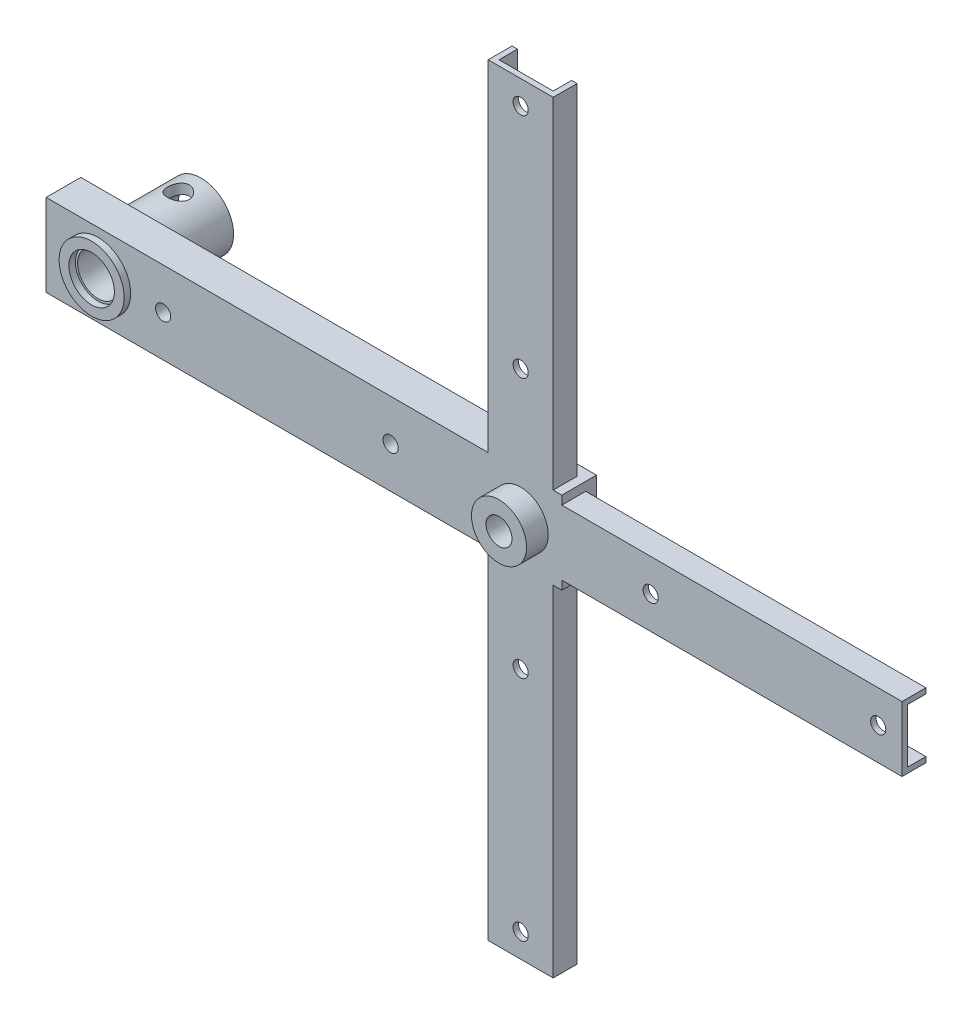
ISO-10303-21;
HEADER;
FILE_DESCRIPTION(('STEP AP214'),'2;1');
FILE_NAME('part.step','',(''),(''),'','','');
FILE_SCHEMA(('AUTOMOTIVE_DESIGN { 1 0 10303 214 1 1 1 1 }'));
ENDSEC;
DATA;
#1=APPLICATION_CONTEXT('core data for automotive mechanical design processes');
#2=APPLICATION_PROTOCOL_DEFINITION('international standard','automotive_design',2000,#1);
#3=PRODUCT_CONTEXT('',#1,'mechanical');
#4=PRODUCT('Part','Part','',(#3));
#5=PRODUCT_RELATED_PRODUCT_CATEGORY('part','',(#4));
#6=PRODUCT_DEFINITION_FORMATION('','',#4);
#7=PRODUCT_DEFINITION_CONTEXT('part definition',#1,'design');
#8=PRODUCT_DEFINITION('design','',#6,#7);
#9=PRODUCT_DEFINITION_SHAPE('','',#8);
#10=(LENGTH_UNIT() NAMED_UNIT(*) SI_UNIT(.MILLI.,.METRE.));
#11=(NAMED_UNIT(*) PLANE_ANGLE_UNIT() SI_UNIT($,.RADIAN.));
#12=(NAMED_UNIT(*) SI_UNIT($,.STERADIAN.) SOLID_ANGLE_UNIT());
#13=UNCERTAINTY_MEASURE_WITH_UNIT(LENGTH_MEASURE(1.E-05),#10,'distance_accuracy_value','');
#14=(GEOMETRIC_REPRESENTATION_CONTEXT(3) GLOBAL_UNCERTAINTY_ASSIGNED_CONTEXT((#13)) GLOBAL_UNIT_ASSIGNED_CONTEXT((#10,
#11,#12)) REPRESENTATION_CONTEXT('',''));
#15=CARTESIAN_POINT('',(0.,0.,0.));
#16=DIRECTION('',(0.,0.,1.));
#17=DIRECTION('',(1.,0.,0.));
#18=AXIS2_PLACEMENT_3D('',#15,#16,#17);
#19=CARTESIAN_POINT('',(926.709891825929,536.403759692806,13.5));
#20=DIRECTION('',(0.,-1.,0.));
#21=DIRECTION('',(0.,0.,-1.));
#22=AXIS2_PLACEMENT_3D('',#19,#20,#21);
#23=PLANE('',#22);
#24=DIRECTION('',(-1.,0.,0.));
#25=VECTOR('',#24,1.);
#26=CARTESIAN_POINT('',(926.709891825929,536.403759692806,5.));
#27=LINE('',#26,#25);
#28=CARTESIAN_POINT('',(926.709891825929,536.403759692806,5.));
#29=VERTEX_POINT('',#28);
#30=CARTESIAN_POINT('',(913.709891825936,536.403759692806,5.));
#31=VERTEX_POINT('',#30);
#32=EDGE_CURVE('P0_E56',#29,#31,#27,.T.);
#33=ORIENTED_EDGE('',*,*,#32,.F.);
#34=DIRECTION('',(0.,0.,-1.));
#35=VECTOR('',#34,1.);
#36=CARTESIAN_POINT('',(926.709891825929,536.403759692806,13.5));
#37=LINE('',#36,#35);
#38=CARTESIAN_POINT('',(926.709891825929,536.403759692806,13.5));
#39=VERTEX_POINT('',#38);
#40=EDGE_CURVE('P0_E11',#39,#29,#37,.T.);
#41=ORIENTED_EDGE('',*,*,#40,.F.);
#42=DIRECTION('',(-1.,0.,0.));
#43=VECTOR('',#42,1.);
#44=CARTESIAN_POINT('',(926.709891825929,536.403759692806,13.5));
#45=LINE('',#44,#43);
#46=CARTESIAN_POINT('',(913.709891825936,536.403759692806,13.5));
#47=VERTEX_POINT('',#46);
#48=EDGE_CURVE('P0_E58',#39,#47,#45,.T.);
#49=ORIENTED_EDGE('',*,*,#48,.T.);
#50=DIRECTION('',(0.,0.,-1.));
#51=VECTOR('',#50,1.);
#52=CARTESIAN_POINT('',(913.709891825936,536.403759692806,13.5));
#53=LINE('',#52,#51);
#54=EDGE_CURVE('P0_E19',#47,#31,#53,.T.);
#55=ORIENTED_EDGE('',*,*,#54,.T.);
#56=EDGE_LOOP('',(#33,#41,#49,#55));
#57=FACE_BOUND('',#56,.T.);
#58=ADVANCED_FACE('P0_F16',(#57),#23,.T.);
#59=CARTESIAN_POINT('',(926.709891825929,549.403759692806,13.5));
#60=DIRECTION('',(1.,0.,0.));
#61=DIRECTION('',(0.,0.,-1.));
#62=AXIS2_PLACEMENT_3D('',#59,#60,#61);
#63=PLANE('',#62);
#64=DIRECTION('',(0.,-1.,0.));
#65=VECTOR('',#64,1.);
#66=CARTESIAN_POINT('',(926.709891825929,549.403759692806,5.));
#67=LINE('',#66,#65);
#68=CARTESIAN_POINT('',(926.709891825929,549.403759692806,5.));
#69=VERTEX_POINT('',#68);
#70=EDGE_CURVE('P0_E73',#69,#29,#67,.T.);
#71=ORIENTED_EDGE('',*,*,#70,.F.);
#72=DIRECTION('',(0.,0.,-1.));
#73=VECTOR('',#72,1.);
#74=CARTESIAN_POINT('',(926.709891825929,549.403759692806,13.5));
#75=LINE('',#74,#73);
#76=CARTESIAN_POINT('',(926.709891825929,549.403759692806,13.5));
#77=VERTEX_POINT('',#76);
#78=EDGE_CURVE('P0_E24',#77,#69,#75,.T.);
#79=ORIENTED_EDGE('',*,*,#78,.F.);
#80=DIRECTION('',(0.,-1.,0.));
#81=VECTOR('',#80,1.);
#82=CARTESIAN_POINT('',(926.709891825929,549.403759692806,13.5));
#83=LINE('',#82,#81);
#84=EDGE_CURVE('P0_E63',#77,#39,#83,.T.);
#85=ORIENTED_EDGE('',*,*,#84,.T.);
#86=ORIENTED_EDGE('',*,*,#40,.T.);
#87=EDGE_LOOP('',(#71,#79,#85,#86));
#88=FACE_BOUND('',#87,.T.);
#89=ADVANCED_FACE('P0_F93',(#88),#63,.T.);
#90=CARTESIAN_POINT('',(926.709891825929,549.403759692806,13.5));
#91=DIRECTION('',(0.,1.,0.));
#92=DIRECTION('',(0.,0.,1.));
#93=AXIS2_PLACEMENT_3D('',#90,#91,#92);
#94=PLANE('',#93);
#95=DIRECTION('',(1.,0.,0.));
#96=VECTOR('',#95,1.);
#97=CARTESIAN_POINT('',(926.709891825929,549.403759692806,5.));
#98=LINE('',#97,#96);
#99=CARTESIAN_POINT('',(913.709891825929,549.403759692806,5.));
#100=VERTEX_POINT('',#99);
#101=EDGE_CURVE('P0_E70',#100,#69,#98,.T.);
#102=ORIENTED_EDGE('',*,*,#101,.F.);
#103=DIRECTION('',(0.,0.,-1.));
#104=VECTOR('',#103,1.);
#105=CARTESIAN_POINT('',(913.709891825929,549.403759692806,13.5));
#106=LINE('',#105,#104);
#107=CARTESIAN_POINT('',(913.709891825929,549.403759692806,13.5));
#108=VERTEX_POINT('',#107);
#109=EDGE_CURVE('P0_E62',#108,#100,#106,.T.);
#110=ORIENTED_EDGE('',*,*,#109,.F.);
#111=DIRECTION('',(1.,0.,0.));
#112=VECTOR('',#111,1.);
#113=CARTESIAN_POINT('',(926.709891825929,549.403759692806,13.5));
#114=LINE('',#113,#112);
#115=EDGE_CURVE('P0_E86',#108,#77,#114,.T.);
#116=ORIENTED_EDGE('',*,*,#115,.T.);
#117=ORIENTED_EDGE('',*,*,#78,.T.);
#118=EDGE_LOOP('',(#102,#110,#116,#117));
#119=FACE_BOUND('',#118,.T.);
#120=ADVANCED_FACE('P0_F90',(#119),#94,.T.);
#121=CARTESIAN_POINT('',(913.709891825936,536.403759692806,13.5));
#122=DIRECTION('',(-1.,-5.55111512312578E-13,0.));
#123=DIRECTION('',(5.55111512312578E-13,-1.,0.));
#124=AXIS2_PLACEMENT_3D('',#121,#122,#123);
#125=PLANE('',#124);
#126=DIRECTION('',(-5.55111512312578E-13,1.,0.));
#127=VECTOR('',#126,1.);
#128=CARTESIAN_POINT('',(913.709891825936,536.403759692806,5.));
#129=LINE('',#128,#127);
#130=EDGE_CURVE('P0_E65',#31,#100,#129,.T.);
#131=ORIENTED_EDGE('',*,*,#130,.F.);
#132=ORIENTED_EDGE('',*,*,#54,.F.);
#133=DIRECTION('',(-5.55111512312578E-13,1.,0.));
#134=VECTOR('',#133,1.);
#135=CARTESIAN_POINT('',(913.709891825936,536.403759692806,13.5));
#136=LINE('',#135,#134);
#137=EDGE_CURVE('P0_E84',#47,#108,#136,.T.);
#138=ORIENTED_EDGE('',*,*,#137,.T.);
#139=ORIENTED_EDGE('',*,*,#109,.T.);
#140=EDGE_LOOP('',(#131,#132,#138,#139));
#141=FACE_BOUND('',#140,.T.);
#142=ADVANCED_FACE('P0_F66',(#141),#125,.T.);
#143=CARTESIAN_POINT('',(926.709891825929,536.403759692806,13.5));
#144=DIRECTION('',(0.,0.,1.));
#145=DIRECTION('',(1.,0.,0.));
#146=AXIS2_PLACEMENT_3D('',#143,#144,#145);
#147=PLANE('',#146);
#148=CARTESIAN_POINT('',(920.209891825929,542.903759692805,13.5));
#149=DIRECTION('',(0.,0.,-1.));
#150=DIRECTION('',(-1.,0.,0.));
#151=AXIS2_PLACEMENT_3D('',#148,#149,#150);
#152=CIRCLE('',#151,6.);
#153=CARTESIAN_POINT('',(914.209891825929,542.903759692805,13.5));
#154=VERTEX_POINT('',#153);
#155=EDGE_CURVE('P0_E74',#154,#154,#152,.T.);
#156=ORIENTED_EDGE('',*,*,#155,.T.);
#157=EDGE_LOOP('',(#156));
#158=FACE_BOUND('',#157,.T.);
#159=ORIENTED_EDGE('',*,*,#48,.F.);
#160=ORIENTED_EDGE('',*,*,#84,.F.);
#161=ORIENTED_EDGE('',*,*,#115,.F.);
#162=ORIENTED_EDGE('',*,*,#137,.F.);
#163=EDGE_LOOP('',(#159,#160,#161,#162));
#164=FACE_BOUND('',#163,.T.);
#165=ADVANCED_FACE('P0_F95',(#158,#164),#147,.T.);
#166=CARTESIAN_POINT('',(926.709891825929,536.403759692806,5.));
#167=DIRECTION('',(0.,0.,1.));
#168=DIRECTION('',(1.,0.,0.));
#169=AXIS2_PLACEMENT_3D('',#166,#167,#168);
#170=PLANE('',#169);
#171=CARTESIAN_POINT('',(920.209891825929,542.903759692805,5.));
#172=DIRECTION('',(0.,0.,-1.));
#173=DIRECTION('',(-1.,0.,0.));
#174=AXIS2_PLACEMENT_3D('',#171,#172,#173);
#175=CIRCLE('',#174,6.);
#176=CARTESIAN_POINT('',(914.209891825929,542.903759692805,5.));
#177=VERTEX_POINT('',#176);
#178=EDGE_CURVE('P0_E77',#177,#177,#175,.T.);
#179=ORIENTED_EDGE('',*,*,#178,.F.);
#180=EDGE_LOOP('',(#179));
#181=FACE_BOUND('',#180,.T.);
#182=ORIENTED_EDGE('',*,*,#32,.T.);
#183=ORIENTED_EDGE('',*,*,#130,.T.);
#184=ORIENTED_EDGE('',*,*,#101,.T.);
#185=ORIENTED_EDGE('',*,*,#70,.T.);
#186=EDGE_LOOP('',(#182,#183,#184,#185));
#187=FACE_BOUND('',#186,.T.);
#188=ADVANCED_FACE('P0_F72',(#181,#187),#170,.F.);
#189=CARTESIAN_POINT('',(920.209891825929,542.903759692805,13.5));
#190=DIRECTION('',(0.,0.,-1.));
#191=DIRECTION('',(-1.,0.,0.));
#192=AXIS2_PLACEMENT_3D('',#189,#190,#191);
#193=CYLINDRICAL_SURFACE('',#192,6.);
#194=ORIENTED_EDGE('',*,*,#155,.F.);
#195=EDGE_LOOP('',(#194));
#196=FACE_BOUND('',#195,.T.);
#197=ORIENTED_EDGE('',*,*,#178,.T.);
#198=EDGE_LOOP('',(#197));
#199=FACE_BOUND('',#198,.T.);
#200=ADVANCED_FACE('P0_F104',(#196,#199),#193,.F.);
#201=CLOSED_SHELL('',(#58,#89,#120,#142,#165,#188,#200));
#202=MANIFOLD_SOLID_BREP('P0_B1',#201);
#203=CARTESIAN_POINT('',(920.209891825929,542.903759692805,16.));
#204=DIRECTION('',(0.,0.,-1.));
#205=DIRECTION('',(-1.,0.,0.));
#206=AXIS2_PLACEMENT_3D('',#203,#204,#205);
#207=CYLINDRICAL_SURFACE('',#206,10.7);
#208=CARTESIAN_POINT('',(920.209891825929,542.903759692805,-1.));
#209=DIRECTION('',(0.,0.,1.));
#210=DIRECTION('',(1.,0.,0.));
#211=AXIS2_PLACEMENT_3D('',#208,#209,#210);
#212=CIRCLE('',#211,10.7);
#213=CARTESIAN_POINT('',(930.909891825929,542.903759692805,-1.));
#214=VERTEX_POINT('',#213);
#215=EDGE_CURVE('P1_E540',#214,#214,#212,.T.);
#216=ORIENTED_EDGE('',*,*,#215,.F.);
#217=EDGE_LOOP('',(#216));
#218=FACE_BOUND('',#217,.T.);
#219=CARTESIAN_POINT('',(920.209891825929,542.903759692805,17.5));
#220=DIRECTION('',(0.,0.,1.));
#221=DIRECTION('',(1.,0.,0.));
#222=AXIS2_PLACEMENT_3D('',#219,#220,#221);
#223=CIRCLE('',#222,10.7);
#224=CARTESIAN_POINT('',(930.909891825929,542.903759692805,17.5));
#225=VERTEX_POINT('',#224);
#226=EDGE_CURVE('P1_E512',#225,#225,#223,.T.);
#227=ORIENTED_EDGE('',*,*,#226,.T.);
#228=EDGE_LOOP('',(#227));
#229=FACE_BOUND('',#228,.T.);
#230=ADVANCED_FACE('P1_F16',(#218,#229),#207,.F.);
#231=CARTESIAN_POINT('',(935.209891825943,718.903759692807,5.));
#232=DIRECTION('',(0.,1.,0.));
#233=DIRECTION('',(0.,0.,1.));
#234=AXIS2_PLACEMENT_3D('',#231,#232,#233);
#235=PLANE('',#234);
#236=DIRECTION('',(-1.,0.,0.));
#237=VECTOR('',#236,1.);
#238=CARTESIAN_POINT('',(935.209891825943,718.903759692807,5.));
#239=LINE('',#238,#237);
#240=CARTESIAN_POINT('',(935.209891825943,718.903759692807,5.));
#241=VERTEX_POINT('',#240);
#242=CARTESIAN_POINT('',(932.709891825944,718.903759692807,5.));
#243=VERTEX_POINT('',#242);
#244=EDGE_CURVE('P1_E705',#241,#243,#239,.T.);
#245=ORIENTED_EDGE('',*,*,#244,.T.);
#246=DIRECTION('',(0.,0.,1.));
#247=VECTOR('',#246,1.);
#248=CARTESIAN_POINT('',(932.709891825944,718.903759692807,5.));
#249=LINE('',#248,#247);
#250=CARTESIAN_POINT('',(932.709891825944,718.903759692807,13.5));
#251=VERTEX_POINT('',#250);
#252=EDGE_CURVE('P1_E558',#243,#251,#249,.T.);
#253=ORIENTED_EDGE('',*,*,#252,.T.);
#254=DIRECTION('',(1.,0.,0.));
#255=VECTOR('',#254,1.);
#256=CARTESIAN_POINT('',(935.209891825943,718.903759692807,13.5));
#257=LINE('',#256,#255);
#258=CARTESIAN_POINT('',(907.709891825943,718.903759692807,13.5));
#259=VERTEX_POINT('',#258);
#260=EDGE_CURVE('P1_E554',#259,#251,#257,.T.);
#261=ORIENTED_EDGE('',*,*,#260,.F.);
#262=DIRECTION('',(0.,0.,-1.));
#263=VECTOR('',#262,1.);
#264=CARTESIAN_POINT('',(907.709891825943,718.903759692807,5.));
#265=LINE('',#264,#263);
#266=CARTESIAN_POINT('',(907.709891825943,718.903759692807,5.));
#267=VERTEX_POINT('',#266);
#268=EDGE_CURVE('P1_E556',#259,#267,#265,.T.);
#269=ORIENTED_EDGE('',*,*,#268,.T.);
#270=CARTESIAN_POINT('',(905.209891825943,718.903759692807,5.));
#271=VERTEX_POINT('',#270);
#272=EDGE_CURVE('P1_E229',#267,#271,#239,.T.);
#273=ORIENTED_EDGE('',*,*,#272,.T.);
#274=DIRECTION('',(0.,0.,1.));
#275=VECTOR('',#274,1.);
#276=CARTESIAN_POINT('',(905.209891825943,718.903759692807,5.));
#277=LINE('',#276,#275);
#278=CARTESIAN_POINT('',(905.209891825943,718.903759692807,16.));
#279=VERTEX_POINT('',#278);
#280=EDGE_CURVE('P1_E238',#271,#279,#277,.T.);
#281=ORIENTED_EDGE('',*,*,#280,.T.);
#282=DIRECTION('',(-1.,0.,0.));
#283=VECTOR('',#282,1.);
#284=CARTESIAN_POINT('',(935.209891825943,718.903759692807,16.));
#285=LINE('',#284,#283);
#286=CARTESIAN_POINT('',(935.209891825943,718.903759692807,16.));
#287=VERTEX_POINT('',#286);
#288=EDGE_CURVE('P1_E261',#287,#279,#285,.T.);
#289=ORIENTED_EDGE('',*,*,#288,.F.);
#290=DIRECTION('',(0.,0.,1.));
#291=VECTOR('',#290,1.);
#292=CARTESIAN_POINT('',(935.209891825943,718.903759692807,5.));
#293=LINE('',#292,#291);
#294=EDGE_CURVE('P1_E235',#241,#287,#293,.T.);
#295=ORIENTED_EDGE('',*,*,#294,.F.);
#296=EDGE_LOOP('',(#245,#253,#261,#269,#273,#281,#289,#295));
#297=FACE_BOUND('',#296,.T.);
#298=ADVANCED_FACE('P1_F593',(#297),#235,.T.);
#299=CARTESIAN_POINT('',(935.209891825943,718.903759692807,5.));
#300=DIRECTION('',(0.,0.,1.));
#301=DIRECTION('',(1.,0.,0.));
#302=AXIS2_PLACEMENT_3D('',#299,#300,#301);
#303=PLANE('',#302);
#304=DIRECTION('',(0.,1.,0.));
#305=VECTOR('',#304,1.);
#306=CARTESIAN_POINT('',(932.709891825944,561.903759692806,5.));
#307=LINE('',#306,#305);
#308=CARTESIAN_POINT('',(932.709891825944,561.903759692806,5.));
#309=VERTEX_POINT('',#308);
#310=EDGE_CURVE('P1_E37',#309,#243,#307,.T.);
#311=ORIENTED_EDGE('',*,*,#310,.T.);
#312=ORIENTED_EDGE('',*,*,#244,.F.);
#313=DIRECTION('',(0.,1.,0.));
#314=VECTOR('',#313,1.);
#315=CARTESIAN_POINT('',(935.209891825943,561.903759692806,5.));
#316=LINE('',#315,#314);
#317=CARTESIAN_POINT('',(935.209891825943,561.903759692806,5.));
#318=VERTEX_POINT('',#317);
#319=EDGE_CURVE('P1_E260',#318,#241,#316,.T.);
#320=ORIENTED_EDGE('',*,*,#319,.F.);
#321=DIRECTION('',(1.,0.,0.));
#322=VECTOR('',#321,1.);
#323=CARTESIAN_POINT('',(905.209891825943,561.903759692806,5.));
#324=LINE('',#323,#322);
#325=EDGE_CURVE('P1_E236',#309,#318,#324,.T.);
#326=ORIENTED_EDGE('',*,*,#325,.F.);
#327=EDGE_LOOP('',(#311,#312,#320,#326));
#328=FACE_BOUND('',#327,.T.);
#329=ADVANCED_FACE('P1_F599',(#328),#303,.F.);
#330=DIRECTION('',(0.,-1.,0.));
#331=VECTOR('',#330,1.);
#332=CARTESIAN_POINT('',(907.709891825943,724.591103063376,5.));
#333=LINE('',#332,#331);
#334=CARTESIAN_POINT('',(907.709891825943,561.903759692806,5.));
#335=VERTEX_POINT('',#334);
#336=EDGE_CURVE('P1_E212',#267,#335,#333,.T.);
#337=ORIENTED_EDGE('',*,*,#336,.T.);
#338=CARTESIAN_POINT('',(905.209891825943,561.903759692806,5.));
#339=VERTEX_POINT('',#338);
#340=EDGE_CURVE('P1_E227',#339,#335,#324,.T.);
#341=ORIENTED_EDGE('',*,*,#340,.F.);
#342=DIRECTION('',(0.,-1.,0.));
#343=VECTOR('',#342,1.);
#344=CARTESIAN_POINT('',(905.209891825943,718.903759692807,5.));
#345=LINE('',#344,#343);
#346=EDGE_CURVE('P1_E240',#271,#339,#345,.T.);
#347=ORIENTED_EDGE('',*,*,#346,.F.);
#348=ORIENTED_EDGE('',*,*,#272,.F.);
#349=EDGE_LOOP('',(#337,#341,#347,#348));
#350=FACE_BOUND('',#349,.T.);
#351=ADVANCED_FACE('P1_F225',(#350),#303,.F.);
#352=CARTESIAN_POINT('',(935.209891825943,366.903759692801,5.));
#353=DIRECTION('',(0.,-1.,0.));
#354=DIRECTION('',(1.,0.,0.));
#355=AXIS2_PLACEMENT_3D('',#352,#353,#354);
#356=PLANE('',#355);
#357=DIRECTION('',(1.,0.,0.));
#358=VECTOR('',#357,1.);
#359=CARTESIAN_POINT('',(935.209891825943,366.903759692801,13.5));
#360=LINE('',#359,#358);
#361=CARTESIAN_POINT('',(907.709891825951,366.903759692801,13.5));
#362=VERTEX_POINT('',#361);
#363=CARTESIAN_POINT('',(932.709891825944,366.903759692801,13.5));
#364=VERTEX_POINT('',#363);
#365=EDGE_CURVE('P1_E415',#362,#364,#360,.T.);
#366=ORIENTED_EDGE('',*,*,#365,.T.);
#367=DIRECTION('',(0.,0.,-1.));
#368=VECTOR('',#367,1.);
#369=CARTESIAN_POINT('',(932.709891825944,366.903759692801,5.));
#370=LINE('',#369,#368);
#371=CARTESIAN_POINT('',(932.709891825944,366.903759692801,5.));
#372=VERTEX_POINT('',#371);
#373=EDGE_CURVE('P1_E416',#364,#372,#370,.T.);
#374=ORIENTED_EDGE('',*,*,#373,.T.);
#375=DIRECTION('',(1.,0.,0.));
#376=VECTOR('',#375,1.);
#377=CARTESIAN_POINT('',(935.209891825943,366.903759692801,5.));
#378=LINE('',#377,#376);
#379=CARTESIAN_POINT('',(935.209891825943,366.903759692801,5.));
#380=VERTEX_POINT('',#379);
#381=EDGE_CURVE('P1_E368',#372,#380,#378,.T.);
#382=ORIENTED_EDGE('',*,*,#381,.T.);
#383=DIRECTION('',(0.,0.,1.));
#384=VECTOR('',#383,1.);
#385=CARTESIAN_POINT('',(935.209891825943,366.903759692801,5.));
#386=LINE('',#385,#384);
#387=CARTESIAN_POINT('',(935.209891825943,366.903759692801,16.));
#388=VERTEX_POINT('',#387);
#389=EDGE_CURVE('P1_E299',#380,#388,#386,.T.);
#390=ORIENTED_EDGE('',*,*,#389,.T.);
#391=DIRECTION('',(1.,0.,0.));
#392=VECTOR('',#391,1.);
#393=CARTESIAN_POINT('',(935.209891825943,366.903759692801,16.));
#394=LINE('',#393,#392);
#395=CARTESIAN_POINT('',(905.209891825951,366.903759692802,16.));
#396=VERTEX_POINT('',#395);
#397=EDGE_CURVE('P1_E293',#396,#388,#394,.T.);
#398=ORIENTED_EDGE('',*,*,#397,.F.);
#399=DIRECTION('',(0.,0.,1.));
#400=VECTOR('',#399,1.);
#401=CARTESIAN_POINT('',(905.209891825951,366.903759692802,5.));
#402=LINE('',#401,#400);
#403=CARTESIAN_POINT('',(905.209891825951,366.903759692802,5.));
#404=VERTEX_POINT('',#403);
#405=EDGE_CURVE('P1_E304',#404,#396,#402,.T.);
#406=ORIENTED_EDGE('',*,*,#405,.F.);
#407=CARTESIAN_POINT('',(907.709891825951,366.903759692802,5.));
#408=VERTEX_POINT('',#407);
#409=EDGE_CURVE('P1_E369',#404,#408,#378,.T.);
#410=ORIENTED_EDGE('',*,*,#409,.T.);
#411=DIRECTION('',(0.,0.,1.));
#412=VECTOR('',#411,1.);
#413=CARTESIAN_POINT('',(907.709891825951,366.903759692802,5.));
#414=LINE('',#413,#412);
#415=EDGE_CURVE('P1_E45',#408,#362,#414,.T.);
#416=ORIENTED_EDGE('',*,*,#415,.T.);
#417=EDGE_LOOP('',(#366,#374,#382,#390,#398,#406,#410,#416));
#418=FACE_BOUND('',#417,.T.);
#419=ADVANCED_FACE('P1_F382',(#418),#356,.T.);
#420=CARTESIAN_POINT('',(935.209891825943,523.903759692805,5.));
#421=DIRECTION('',(0.,0.,-1.));
#422=DIRECTION('',(-1.,0.,0.));
#423=AXIS2_PLACEMENT_3D('',#420,#421,#422);
#424=PLANE('',#423);
#425=ORIENTED_EDGE('',*,*,#381,.F.);
#426=DIRECTION('',(0.,1.,0.));
#427=VECTOR('',#426,1.);
#428=CARTESIAN_POINT('',(932.709891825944,354.90012876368,5.));
#429=LINE('',#428,#427);
#430=CARTESIAN_POINT('',(932.709891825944,523.903759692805,5.));
#431=VERTEX_POINT('',#430);
#432=EDGE_CURVE('P1_E561',#372,#431,#429,.T.);
#433=ORIENTED_EDGE('',*,*,#432,.T.);
#434=DIRECTION('',(-1.,0.,0.));
#435=VECTOR('',#434,1.);
#436=CARTESIAN_POINT('',(905.209891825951,523.903759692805,5.));
#437=LINE('',#436,#435);
#438=CARTESIAN_POINT('',(935.209891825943,523.903759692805,5.));
#439=VERTEX_POINT('',#438);
#440=EDGE_CURVE('P1_E362',#439,#431,#437,.T.);
#441=ORIENTED_EDGE('',*,*,#440,.F.);
#442=DIRECTION('',(0.,1.,0.));
#443=VECTOR('',#442,1.);
#444=CARTESIAN_POINT('',(935.209891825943,523.903759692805,5.));
#445=LINE('',#444,#443);
#446=EDGE_CURVE('P1_E305',#380,#439,#445,.T.);
#447=ORIENTED_EDGE('',*,*,#446,.F.);
#448=EDGE_LOOP('',(#425,#433,#441,#447));
#449=FACE_BOUND('',#448,.T.);
#450=ADVANCED_FACE('P1_F590',(#449),#424,.T.);
#451=CARTESIAN_POINT('',(907.709891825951,523.903759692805,5.));
#452=VERTEX_POINT('',#451);
#453=CARTESIAN_POINT('',(905.209891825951,523.903759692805,5.));
#454=VERTEX_POINT('',#453);
#455=EDGE_CURVE('P1_E292',#452,#454,#437,.T.);
#456=ORIENTED_EDGE('',*,*,#455,.F.);
#457=DIRECTION('',(0.,-1.,0.));
#458=VECTOR('',#457,1.);
#459=CARTESIAN_POINT('',(907.709891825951,523.903759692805,5.));
#460=LINE('',#459,#458);
#461=EDGE_CURVE('P1_E413',#452,#408,#460,.T.);
#462=ORIENTED_EDGE('',*,*,#461,.T.);
#463=ORIENTED_EDGE('',*,*,#409,.F.);
#464=DIRECTION('',(0.,-1.,0.));
#465=VECTOR('',#464,1.);
#466=CARTESIAN_POINT('',(905.209891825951,366.903759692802,5.));
#467=LINE('',#466,#465);
#468=EDGE_CURVE('P1_E365',#454,#404,#467,.T.);
#469=ORIENTED_EDGE('',*,*,#468,.F.);
#470=EDGE_LOOP('',(#456,#462,#463,#469));
#471=FACE_BOUND('',#470,.T.);
#472=ADVANCED_FACE('P1_F412',(#471),#424,.T.);
#473=CARTESIAN_POINT('',(920.209891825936,377.903759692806,5.));
#474=DIRECTION('',(0.,0.,1.));
#475=DIRECTION('',(1.,0.,0.));
#476=AXIS2_PLACEMENT_3D('',#473,#474,#475);
#477=CYLINDRICAL_SURFACE('',#476,3.5);
#478=CARTESIAN_POINT('',(920.209891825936,377.903759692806,16.));
#479=DIRECTION('',(0.,0.,1.));
#480=DIRECTION('',(1.,0.,0.));
#481=AXIS2_PLACEMENT_3D('',#478,#479,#480);
#482=CIRCLE('',#481,3.5);
#483=CARTESIAN_POINT('',(923.709891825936,377.903759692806,16.));
#484=VERTEX_POINT('',#483);
#485=EDGE_CURVE('P1_E352',#484,#484,#482,.T.);
#486=ORIENTED_EDGE('',*,*,#485,.T.);
#487=EDGE_LOOP('',(#486));
#488=FACE_BOUND('',#487,.T.);
#489=CARTESIAN_POINT('',(920.209891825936,377.903759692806,13.5));
#490=DIRECTION('',(0.,0.,-1.));
#491=DIRECTION('',(-1.,0.,0.));
#492=AXIS2_PLACEMENT_3D('',#489,#490,#491);
#493=CIRCLE('',#492,3.5);
#494=CARTESIAN_POINT('',(916.709891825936,377.903759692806,13.5));
#495=VERTEX_POINT('',#494);
#496=EDGE_CURVE('P1_E420',#495,#495,#493,.F.);
#497=ORIENTED_EDGE('',*,*,#496,.F.);
#498=EDGE_LOOP('',(#497));
#499=FACE_BOUND('',#498,.T.);
#500=ADVANCED_FACE('P1_F578',(#488,#499),#477,.F.);
#501=CARTESIAN_POINT('',(920.209891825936,482.903759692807,5.));
#502=DIRECTION('',(0.,0.,1.));
#503=DIRECTION('',(1.,0.,0.));
#504=AXIS2_PLACEMENT_3D('',#501,#502,#503);
#505=CYLINDRICAL_SURFACE('',#504,3.5);
#506=CARTESIAN_POINT('',(920.209891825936,482.903759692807,16.));
#507=DIRECTION('',(0.,0.,1.));
#508=DIRECTION('',(1.,0.,0.));
#509=AXIS2_PLACEMENT_3D('',#506,#507,#508);
#510=CIRCLE('',#509,3.5);
#511=CARTESIAN_POINT('',(923.709891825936,482.903759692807,16.));
#512=VERTEX_POINT('',#511);
#513=EDGE_CURVE('P1_E251',#512,#512,#510,.T.);
#514=ORIENTED_EDGE('',*,*,#513,.T.);
#515=EDGE_LOOP('',(#514));
#516=FACE_BOUND('',#515,.T.);
#517=CARTESIAN_POINT('',(920.209891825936,482.903759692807,13.5));
#518=DIRECTION('',(0.,0.,-1.));
#519=DIRECTION('',(-1.,0.,0.));
#520=AXIS2_PLACEMENT_3D('',#517,#518,#519);
#521=CIRCLE('',#520,3.5);
#522=CARTESIAN_POINT('',(916.709891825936,482.903759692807,13.5));
#523=VERTEX_POINT('',#522);
#524=EDGE_CURVE('P1_E501',#523,#523,#521,.F.);
#525=ORIENTED_EDGE('',*,*,#524,.F.);
#526=EDGE_LOOP('',(#525));
#527=FACE_BOUND('',#526,.T.);
#528=ADVANCED_FACE('P1_F580',(#516,#527),#505,.F.);
#529=CARTESIAN_POINT('',(1096.20989182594,527.903759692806,5.));
#530=DIRECTION('',(1.,0.,0.));
#531=DIRECTION('',(0.,0.,-1.));
#532=AXIS2_PLACEMENT_3D('',#529,#530,#531);
#533=PLANE('',#532);
#534=DIRECTION('',(0.,1.,0.));
#535=VECTOR('',#534,1.);
#536=CARTESIAN_POINT('',(1096.20989182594,527.903759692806,5.));
#537=LINE('',#536,#535);
#538=CARTESIAN_POINT('',(1096.20989182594,527.903759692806,5.));
#539=VERTEX_POINT('',#538);
#540=CARTESIAN_POINT('',(1096.20989182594,530.403759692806,5.));
#541=VERTEX_POINT('',#540);
#542=EDGE_CURVE('P1_E463',#539,#541,#537,.T.);
#543=ORIENTED_EDGE('',*,*,#542,.T.);
#544=DIRECTION('',(0.,0.,1.));
#545=VECTOR('',#544,1.);
#546=CARTESIAN_POINT('',(1096.20989182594,530.403759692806,5.));
#547=LINE('',#546,#545);
#548=CARTESIAN_POINT('',(1096.20989182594,530.403759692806,13.5));
#549=VERTEX_POINT('',#548);
#550=EDGE_CURVE('P1_E450',#541,#549,#547,.T.);
#551=ORIENTED_EDGE('',*,*,#550,.T.);
#552=DIRECTION('',(0.,-1.,0.));
#553=VECTOR('',#552,1.);
#554=CARTESIAN_POINT('',(1096.20989182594,527.903759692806,13.5));
#555=LINE('',#554,#553);
#556=CARTESIAN_POINT('',(1096.20989182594,555.403759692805,13.5));
#557=VERTEX_POINT('',#556);
#558=EDGE_CURVE('P1_E445',#557,#549,#555,.T.);
#559=ORIENTED_EDGE('',*,*,#558,.F.);
#560=DIRECTION('',(0.,0.,-1.));
#561=VECTOR('',#560,1.);
#562=CARTESIAN_POINT('',(1096.20989182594,555.403759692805,5.));
#563=LINE('',#562,#561);
#564=CARTESIAN_POINT('',(1096.20989182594,555.403759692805,5.));
#565=VERTEX_POINT('',#564);
#566=EDGE_CURVE('P1_E447',#557,#565,#563,.T.);
#567=ORIENTED_EDGE('',*,*,#566,.T.);
#568=CARTESIAN_POINT('',(1096.20989182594,557.903759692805,5.));
#569=VERTEX_POINT('',#568);
#570=EDGE_CURVE('P1_E467',#565,#569,#537,.T.);
#571=ORIENTED_EDGE('',*,*,#570,.T.);
#572=DIRECTION('',(0.,0.,1.));
#573=VECTOR('',#572,1.);
#574=CARTESIAN_POINT('',(1096.20989182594,557.903759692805,5.));
#575=LINE('',#574,#573);
#576=CARTESIAN_POINT('',(1096.20989182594,557.903759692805,16.));
#577=VERTEX_POINT('',#576);
#578=EDGE_CURVE('P1_E477',#569,#577,#575,.T.);
#579=ORIENTED_EDGE('',*,*,#578,.T.);
#580=DIRECTION('',(0.,1.,0.));
#581=VECTOR('',#580,1.);
#582=CARTESIAN_POINT('',(1096.20989182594,527.903759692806,16.));
#583=LINE('',#582,#581);
#584=CARTESIAN_POINT('',(1096.20989182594,527.903759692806,16.));
#585=VERTEX_POINT('',#584);
#586=EDGE_CURVE('P1_E459',#585,#577,#583,.T.);
#587=ORIENTED_EDGE('',*,*,#586,.F.);
#588=DIRECTION('',(0.,0.,1.));
#589=VECTOR('',#588,1.);
#590=CARTESIAN_POINT('',(1096.20989182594,527.903759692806,5.));
#591=LINE('',#590,#589);
#592=EDGE_CURVE('P1_E478',#539,#585,#591,.T.);
#593=ORIENTED_EDGE('',*,*,#592,.F.);
#594=EDGE_LOOP('',(#543,#551,#559,#567,#571,#579,#587,#593));
#595=FACE_BOUND('',#594,.T.);
#596=ADVANCED_FACE('P1_F587',(#595),#533,.T.);
#597=CARTESIAN_POINT('',(1096.20989182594,557.903759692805,5.));
#598=DIRECTION('',(0.,0.,1.));
#599=DIRECTION('',(1.,0.,0.));
#600=AXIS2_PLACEMENT_3D('',#597,#598,#599);
#601=PLANE('',#600);
#602=DIRECTION('',(1.,0.,0.));
#603=VECTOR('',#602,1.);
#604=CARTESIAN_POINT('',(939.209891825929,530.403759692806,5.));
#605=LINE('',#604,#603);
#606=CARTESIAN_POINT('',(939.209891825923,530.403759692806,5.));
#607=VERTEX_POINT('',#606);
#608=EDGE_CURVE('P1_E418',#607,#541,#605,.T.);
#609=ORIENTED_EDGE('',*,*,#608,.T.);
#610=ORIENTED_EDGE('',*,*,#542,.F.);
#611=DIRECTION('',(1.,0.,0.));
#612=VECTOR('',#611,1.);
#613=CARTESIAN_POINT('',(1096.20989182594,527.903759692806,5.));
#614=LINE('',#613,#612);
#615=CARTESIAN_POINT('',(939.209891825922,527.903759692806,5.));
#616=VERTEX_POINT('',#615);
#617=EDGE_CURVE('P1_E474',#616,#539,#614,.T.);
#618=ORIENTED_EDGE('',*,*,#617,.F.);
#619=DIRECTION('',(-7.2534570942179E-13,-1.,0.));
#620=VECTOR('',#619,1.);
#621=CARTESIAN_POINT('',(939.209891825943,557.903759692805,5.));
#622=LINE('',#621,#620);
#623=EDGE_CURVE('P1_E470',#607,#616,#622,.T.);
#624=ORIENTED_EDGE('',*,*,#623,.F.);
#625=EDGE_LOOP('',(#609,#610,#618,#624));
#626=FACE_BOUND('',#625,.T.);
#627=ADVANCED_FACE('P1_F625',(#626),#601,.F.);
#628=DIRECTION('',(-1.,0.,0.));
#629=VECTOR('',#628,1.);
#630=CARTESIAN_POINT('',(1103.78991165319,555.403759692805,5.));
#631=LINE('',#630,#629);
#632=CARTESIAN_POINT('',(939.209891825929,555.403759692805,5.));
#633=VERTEX_POINT('',#632);
#634=EDGE_CURVE('P1_E426',#565,#633,#631,.T.);
#635=ORIENTED_EDGE('',*,*,#634,.T.);
#636=CARTESIAN_POINT('',(939.209891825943,557.903759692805,5.));
#637=VERTEX_POINT('',#636);
#638=EDGE_CURVE('P1_E471',#637,#633,#622,.T.);
#639=ORIENTED_EDGE('',*,*,#638,.F.);
#640=DIRECTION('',(-1.,0.,0.));
#641=VECTOR('',#640,1.);
#642=CARTESIAN_POINT('',(1096.20989182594,557.903759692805,5.));
#643=LINE('',#642,#641);
#644=EDGE_CURVE('P1_E466',#569,#637,#643,.T.);
#645=ORIENTED_EDGE('',*,*,#644,.F.);
#646=ORIENTED_EDGE('',*,*,#570,.F.);
#647=EDGE_LOOP('',(#635,#639,#645,#646));
#648=FACE_BOUND('',#647,.T.);
#649=ADVANCED_FACE('P1_F621',(#648),#601,.F.);
#650=CARTESIAN_POINT('',(939.209891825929,523.903759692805,16.));
#651=DIRECTION('',(-1.,0.,0.));
#652=DIRECTION('',(0.,0.,1.));
#653=AXIS2_PLACEMENT_3D('',#650,#651,#652);
#654=PLANE('',#653);
#655=DIRECTION('',(0.,0.,1.));
#656=VECTOR('',#655,1.);
#657=CARTESIAN_POINT('',(939.209891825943,557.903759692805,5.));
#658=LINE('',#657,#656);
#659=CARTESIAN_POINT('',(939.209891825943,557.903759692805,16.));
#660=VERTEX_POINT('',#659);
#661=EDGE_CURVE('P1_E489',#637,#660,#658,.T.);
#662=ORIENTED_EDGE('',*,*,#661,.F.);
#663=ORIENTED_EDGE('',*,*,#638,.T.);
#664=DIRECTION('',(0.,0.,-1.));
#665=VECTOR('',#664,1.);
#666=CARTESIAN_POINT('',(939.209891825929,555.403759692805,13.5));
#667=LINE('',#666,#665);
#668=CARTESIAN_POINT('',(939.209891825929,555.403759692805,13.5));
#669=VERTEX_POINT('',#668);
#670=EDGE_CURVE('P1_E439',#669,#633,#667,.T.);
#671=ORIENTED_EDGE('',*,*,#670,.F.);
#672=DIRECTION('',(0.,-1.,0.));
#673=VECTOR('',#672,1.);
#674=CARTESIAN_POINT('',(939.209891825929,530.403759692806,13.5));
#675=LINE('',#674,#673);
#676=CARTESIAN_POINT('',(939.209891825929,530.403759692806,13.5));
#677=VERTEX_POINT('',#676);
#678=EDGE_CURVE('P1_E434',#669,#677,#675,.T.);
#679=ORIENTED_EDGE('',*,*,#678,.T.);
#680=DIRECTION('',(0.,0.,-1.));
#681=VECTOR('',#680,1.);
#682=CARTESIAN_POINT('',(939.209891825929,530.403759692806,13.5));
#683=LINE('',#682,#681);
#684=EDGE_CURVE('P1_E436',#677,#607,#683,.T.);
#685=ORIENTED_EDGE('',*,*,#684,.T.);
#686=ORIENTED_EDGE('',*,*,#623,.T.);
#687=DIRECTION('',(0.,0.,1.));
#688=VECTOR('',#687,1.);
#689=CARTESIAN_POINT('',(939.209891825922,527.903759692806,5.));
#690=LINE('',#689,#688);
#691=CARTESIAN_POINT('',(939.209891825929,527.903759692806,16.));
#692=VERTEX_POINT('',#691);
#693=EDGE_CURVE('P1_E481',#616,#692,#690,.T.);
#694=ORIENTED_EDGE('',*,*,#693,.T.);
#695=DIRECTION('',(0.,1.,0.));
#696=VECTOR('',#695,1.);
#697=CARTESIAN_POINT('',(939.209891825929,523.903759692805,16.));
#698=LINE('',#697,#696);
#699=CARTESIAN_POINT('',(939.209891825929,523.903759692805,16.));
#700=VERTEX_POINT('',#699);
#701=EDGE_CURVE('P1_E264',#700,#692,#698,.T.);
#702=ORIENTED_EDGE('',*,*,#701,.F.);
#703=DIRECTION('',(0.,0.,-1.));
#704=VECTOR('',#703,1.);
#705=CARTESIAN_POINT('',(939.209891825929,523.903759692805,16.));
#706=LINE('',#705,#704);
#707=CARTESIAN_POINT('',(939.209891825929,523.903759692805,0.));
#708=VERTEX_POINT('',#707);
#709=EDGE_CURVE('P1_E394',#700,#708,#706,.T.);
#710=ORIENTED_EDGE('',*,*,#709,.T.);
#711=DIRECTION('',(0.,1.,0.));
#712=VECTOR('',#711,1.);
#713=CARTESIAN_POINT('',(939.209891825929,523.903759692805,0.));
#714=LINE('',#713,#712);
#715=CARTESIAN_POINT('',(939.209891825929,561.903759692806,0.));
#716=VERTEX_POINT('',#715);
#717=EDGE_CURVE('P1_E332',#708,#716,#714,.T.);
#718=ORIENTED_EDGE('',*,*,#717,.T.);
#719=DIRECTION('',(0.,0.,-1.));
#720=VECTOR('',#719,1.);
#721=CARTESIAN_POINT('',(939.209891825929,561.903759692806,16.));
#722=LINE('',#721,#720);
#723=CARTESIAN_POINT('',(939.209891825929,561.903759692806,16.));
#724=VERTEX_POINT('',#723);
#725=EDGE_CURVE('P1_E398',#724,#716,#722,.T.);
#726=ORIENTED_EDGE('',*,*,#725,.F.);
#727=EDGE_CURVE('P1_E269',#660,#724,#698,.T.);
#728=ORIENTED_EDGE('',*,*,#727,.F.);
#729=EDGE_LOOP('',(#662,#663,#671,#679,#685,#686,#694,#702,#710,#718,#726,#728));
#730=FACE_BOUND('',#729,.T.);
#731=ADVANCED_FACE('P1_F619',(#730),#654,.F.);
#732=CARTESIAN_POINT('',(939.209891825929,561.903759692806,16.));
#733=DIRECTION('',(0.,-1.,0.));
#734=DIRECTION('',(1.,0.,0.));
#735=AXIS2_PLACEMENT_3D('',#732,#733,#734);
#736=PLANE('',#735);
#737=DIRECTION('',(0.,0.,1.));
#738=VECTOR('',#737,1.);
#739=CARTESIAN_POINT('',(905.209891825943,561.903759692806,5.));
#740=LINE('',#739,#738);
#741=CARTESIAN_POINT('',(905.209891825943,561.903759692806,16.));
#742=VERTEX_POINT('',#741);
#743=EDGE_CURVE('P1_E234',#339,#742,#740,.T.);
#744=ORIENTED_EDGE('',*,*,#743,.F.);
#745=ORIENTED_EDGE('',*,*,#340,.T.);
#746=DIRECTION('',(0.,0.,-1.));
#747=VECTOR('',#746,1.);
#748=CARTESIAN_POINT('',(907.709891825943,561.903759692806,13.5));
#749=LINE('',#748,#747);
#750=CARTESIAN_POINT('',(907.709891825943,561.903759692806,13.5));
#751=VERTEX_POINT('',#750);
#752=EDGE_CURVE('P1_E209',#751,#335,#749,.T.);
#753=ORIENTED_EDGE('',*,*,#752,.F.);
#754=DIRECTION('',(1.,0.,0.));
#755=VECTOR('',#754,1.);
#756=CARTESIAN_POINT('',(932.709891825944,561.903759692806,13.5));
#757=LINE('',#756,#755);
#758=CARTESIAN_POINT('',(932.709891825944,561.903759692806,13.5));
#759=VERTEX_POINT('',#758);
#760=EDGE_CURVE('P1_E549',#751,#759,#757,.T.);
#761=ORIENTED_EDGE('',*,*,#760,.T.);
#762=DIRECTION('',(0.,0.,-1.));
#763=VECTOR('',#762,1.);
#764=CARTESIAN_POINT('',(932.709891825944,561.903759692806,13.5));
#765=LINE('',#764,#763);
#766=EDGE_CURVE('P1_E220',#759,#309,#765,.T.);
#767=ORIENTED_EDGE('',*,*,#766,.T.);
#768=ORIENTED_EDGE('',*,*,#325,.T.);
#769=DIRECTION('',(0.,0.,1.));
#770=VECTOR('',#769,1.);
#771=CARTESIAN_POINT('',(935.209891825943,561.903759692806,5.));
#772=LINE('',#771,#770);
#773=CARTESIAN_POINT('',(935.209891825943,561.903759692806,16.));
#774=VERTEX_POINT('',#773);
#775=EDGE_CURVE('P1_E247',#318,#774,#772,.T.);
#776=ORIENTED_EDGE('',*,*,#775,.T.);
#777=DIRECTION('',(-1.,0.,0.));
#778=VECTOR('',#777,1.);
#779=CARTESIAN_POINT('',(939.209891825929,561.903759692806,16.));
#780=LINE('',#779,#778);
#781=EDGE_CURVE('P1_E284',#724,#774,#780,.T.);
#782=ORIENTED_EDGE('',*,*,#781,.F.);
#783=ORIENTED_EDGE('',*,*,#725,.T.);
#784=DIRECTION('',(-1.,0.,0.));
#785=VECTOR('',#784,1.);
#786=CARTESIAN_POINT('',(939.209891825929,561.903759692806,0.));
#787=LINE('',#786,#785);
#788=CARTESIAN_POINT('',(701.209891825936,561.903759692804,0.));
#789=VERTEX_POINT('',#788);
#790=EDGE_CURVE('P1_E334',#716,#789,#787,.T.);
#791=ORIENTED_EDGE('',*,*,#790,.T.);
#792=DIRECTION('',(0.,0.,-1.));
#793=VECTOR('',#792,1.);
#794=CARTESIAN_POINT('',(701.209891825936,561.903759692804,16.));
#795=LINE('',#794,#793);
#796=CARTESIAN_POINT('',(701.209891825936,561.903759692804,16.));
#797=VERTEX_POINT('',#796);
#798=EDGE_CURVE('P1_E402',#797,#789,#795,.T.);
#799=ORIENTED_EDGE('',*,*,#798,.F.);
#800=EDGE_CURVE('P1_E268',#742,#797,#780,.T.);
#801=ORIENTED_EDGE('',*,*,#800,.F.);
#802=EDGE_LOOP('',(#744,#745,#753,#761,#767,#768,#776,#782,#783,#791,#799,#801));
#803=FACE_BOUND('',#802,.T.);
#804=ADVANCED_FACE('P1_F232',(#803),#736,.F.);
#805=CARTESIAN_POINT('',(701.209891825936,523.903759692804,16.));
#806=DIRECTION('',(0.,1.,0.));
#807=DIRECTION('',(-1.,0.,0.));
#808=AXIS2_PLACEMENT_3D('',#805,#806,#807);
#809=PLANE('',#808);
#810=DIRECTION('',(0.,0.,1.));
#811=VECTOR('',#810,1.);
#812=CARTESIAN_POINT('',(935.209891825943,523.903759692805,5.));
#813=LINE('',#812,#811);
#814=CARTESIAN_POINT('',(935.209891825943,523.903759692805,16.));
#815=VERTEX_POINT('',#814);
#816=EDGE_CURVE('P1_E296',#439,#815,#813,.T.);
#817=ORIENTED_EDGE('',*,*,#816,.F.);
#818=ORIENTED_EDGE('',*,*,#440,.T.);
#819=DIRECTION('',(0.,0.,-1.));
#820=VECTOR('',#819,1.);
#821=CARTESIAN_POINT('',(932.709891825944,523.903759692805,13.5));
#822=LINE('',#821,#820);
#823=CARTESIAN_POINT('',(932.709891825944,523.903759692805,13.5));
#824=VERTEX_POINT('',#823);
#825=EDGE_CURVE('P1_E504',#824,#431,#822,.T.);
#826=ORIENTED_EDGE('',*,*,#825,.F.);
#827=DIRECTION('',(-1.,0.,0.));
#828=VECTOR('',#827,1.);
#829=CARTESIAN_POINT('',(907.709891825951,523.903759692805,13.5));
#830=LINE('',#829,#828);
#831=CARTESIAN_POINT('',(907.709891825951,523.903759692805,13.5));
#832=VERTEX_POINT('',#831);
#833=EDGE_CURVE('P1_E567',#824,#832,#830,.T.);
#834=ORIENTED_EDGE('',*,*,#833,.T.);
#835=DIRECTION('',(0.,0.,-1.));
#836=VECTOR('',#835,1.);
#837=CARTESIAN_POINT('',(907.709891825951,523.903759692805,13.5));
#838=LINE('',#837,#836);
#839=EDGE_CURVE('P1_E571',#832,#452,#838,.T.);
#840=ORIENTED_EDGE('',*,*,#839,.T.);
#841=ORIENTED_EDGE('',*,*,#455,.T.);
#842=DIRECTION('',(0.,0.,1.));
#843=VECTOR('',#842,1.);
#844=CARTESIAN_POINT('',(905.209891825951,523.903759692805,5.));
#845=LINE('',#844,#843);
#846=CARTESIAN_POINT('',(905.209891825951,523.903759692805,16.));
#847=VERTEX_POINT('',#846);
#848=EDGE_CURVE('P1_E300',#454,#847,#845,.T.);
#849=ORIENTED_EDGE('',*,*,#848,.T.);
#850=DIRECTION('',(1.,0.,0.));
#851=VECTOR('',#850,1.);
#852=CARTESIAN_POINT('',(701.209891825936,523.903759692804,16.));
#853=LINE('',#852,#851);
#854=CARTESIAN_POINT('',(701.209891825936,523.903759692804,16.));
#855=VERTEX_POINT('',#854);
#856=EDGE_CURVE('P1_E342',#855,#847,#853,.T.);
#857=ORIENTED_EDGE('',*,*,#856,.F.);
#858=DIRECTION('',(0.,0.,-1.));
#859=VECTOR('',#858,1.);
#860=CARTESIAN_POINT('',(701.209891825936,523.903759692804,16.));
#861=LINE('',#860,#859);
#862=CARTESIAN_POINT('',(701.209891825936,523.903759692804,0.));
#863=VERTEX_POINT('',#862);
#864=EDGE_CURVE('P1_E405',#855,#863,#861,.T.);
#865=ORIENTED_EDGE('',*,*,#864,.T.);
#866=DIRECTION('',(1.,0.,0.));
#867=VECTOR('',#866,1.);
#868=CARTESIAN_POINT('',(701.209891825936,523.903759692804,0.));
#869=LINE('',#868,#867);
#870=EDGE_CURVE('P1_E329',#863,#708,#869,.T.);
#871=ORIENTED_EDGE('',*,*,#870,.T.);
#872=ORIENTED_EDGE('',*,*,#709,.F.);
#873=EDGE_CURVE('P1_E336',#815,#700,#853,.T.);
#874=ORIENTED_EDGE('',*,*,#873,.F.);
#875=EDGE_LOOP('',(#817,#818,#826,#834,#840,#841,#849,#857,#865,#871,#872,#874));
#876=FACE_BOUND('',#875,.T.);
#877=ADVANCED_FACE('P1_F18',(#876),#809,.F.);
#878=CARTESIAN_POINT('',(939.209891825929,523.903759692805,16.));
#879=DIRECTION('',(0.,0.,1.));
#880=DIRECTION('',(1.,0.,0.));
#881=AXIS2_PLACEMENT_3D('',#878,#879,#880);
#882=PLANE('',#881);
#883=CARTESIAN_POINT('',(725.209891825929,542.903759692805,16.));
#884=DIRECTION('',(0.,0.,1.));
#885=DIRECTION('',(1.,0.,0.));
#886=AXIS2_PLACEMENT_3D('',#883,#884,#885);
#887=CIRCLE('',#886,15.);
#888=CARTESIAN_POINT('',(740.209891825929,542.903759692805,16.));
#889=VERTEX_POINT('',#888);
#890=EDGE_CURVE('P1_E11',#889,#889,#887,.T.);
#891=ORIENTED_EDGE('',*,*,#890,.F.);
#892=EDGE_LOOP('',(#891));
#893=FACE_BOUND('',#892,.T.);
#894=CARTESIAN_POINT('',(920.209891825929,542.903759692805,16.));
#895=DIRECTION('',(0.,0.,1.));
#896=DIRECTION('',(1.,0.,0.));
#897=AXIS2_PLACEMENT_3D('',#894,#895,#896);
#898=CIRCLE('',#897,12.7);
#899=CARTESIAN_POINT('',(932.909891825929,542.903759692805,16.));
#900=VERTEX_POINT('',#899);
#901=EDGE_CURVE('P1_E397',#900,#900,#898,.T.);
#902=ORIENTED_EDGE('',*,*,#901,.F.);
#903=EDGE_LOOP('',(#902));
#904=FACE_BOUND('',#903,.T.);
#905=CARTESIAN_POINT('',(860.209891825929,542.903759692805,16.));
#906=DIRECTION('',(0.,0.,1.));
#907=DIRECTION('',(1.,0.,0.));
#908=AXIS2_PLACEMENT_3D('',#905,#906,#907);
#909=CIRCLE('',#908,3.5);
#910=CARTESIAN_POINT('',(863.709891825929,542.903759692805,16.));
#911=VERTEX_POINT('',#910);
#912=EDGE_CURVE('P1_E320',#911,#911,#909,.T.);
#913=ORIENTED_EDGE('',*,*,#912,.F.);
#914=EDGE_LOOP('',(#913));
#915=FACE_BOUND('',#914,.T.);
#916=ORIENTED_EDGE('',*,*,#856,.T.);
#917=DIRECTION('',(0.,-1.,0.));
#918=VECTOR('',#917,1.);
#919=CARTESIAN_POINT('',(905.209891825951,366.903759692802,16.));
#920=LINE('',#919,#918);
#921=EDGE_CURVE('P1_E350',#847,#396,#920,.T.);
#922=ORIENTED_EDGE('',*,*,#921,.T.);
#923=ORIENTED_EDGE('',*,*,#397,.T.);
#924=DIRECTION('',(0.,1.,0.));
#925=VECTOR('',#924,1.);
#926=CARTESIAN_POINT('',(935.209891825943,523.903759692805,16.));
#927=LINE('',#926,#925);
#928=EDGE_CURVE('P1_E289',#388,#815,#927,.T.);
#929=ORIENTED_EDGE('',*,*,#928,.T.);
#930=ORIENTED_EDGE('',*,*,#873,.T.);
#931=ORIENTED_EDGE('',*,*,#701,.T.);
#932=DIRECTION('',(1.,0.,0.));
#933=VECTOR('',#932,1.);
#934=CARTESIAN_POINT('',(1096.20989182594,527.903759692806,16.));
#935=LINE('',#934,#933);
#936=EDGE_CURVE('P1_E496',#692,#585,#935,.T.);
#937=ORIENTED_EDGE('',*,*,#936,.T.);
#938=ORIENTED_EDGE('',*,*,#586,.T.);
#939=DIRECTION('',(-1.,0.,0.));
#940=VECTOR('',#939,1.);
#941=CARTESIAN_POINT('',(1096.20989182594,557.903759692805,16.));
#942=LINE('',#941,#940);
#943=EDGE_CURVE('P1_E462',#577,#660,#942,.T.);
#944=ORIENTED_EDGE('',*,*,#943,.T.);
#945=ORIENTED_EDGE('',*,*,#727,.T.);
#946=ORIENTED_EDGE('',*,*,#781,.T.);
#947=DIRECTION('',(0.,1.,0.));
#948=VECTOR('',#947,1.);
#949=CARTESIAN_POINT('',(935.209891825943,561.903759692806,16.));
#950=LINE('',#949,#948);
#951=EDGE_CURVE('P1_E695',#774,#287,#950,.T.);
#952=ORIENTED_EDGE('',*,*,#951,.T.);
#953=ORIENTED_EDGE('',*,*,#288,.T.);
#954=DIRECTION('',(0.,-1.,0.));
#955=VECTOR('',#954,1.);
#956=CARTESIAN_POINT('',(905.209891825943,718.903759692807,16.));
#957=LINE('',#956,#955);
#958=EDGE_CURVE('P1_E257',#279,#742,#957,.T.);
#959=ORIENTED_EDGE('',*,*,#958,.T.);
#960=ORIENTED_EDGE('',*,*,#800,.T.);
#961=DIRECTION('',(0.,-1.,0.));
#962=VECTOR('',#961,1.);
#963=CARTESIAN_POINT('',(701.209891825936,523.903759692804,16.));
#964=LINE('',#963,#962);
#965=EDGE_CURVE('P1_E279',#797,#855,#964,.T.);
#966=ORIENTED_EDGE('',*,*,#965,.T.);
#967=EDGE_LOOP('',(#916,#922,#923,#929,#930,#931,#937,#938,#944,#945,#946,#952,#953,#959,#960,#966));
#968=FACE_BOUND('',#967,.T.);
#969=CARTESIAN_POINT('',(755.209891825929,542.903759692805,16.));
#970=DIRECTION('',(0.,0.,1.));
#971=DIRECTION('',(1.,0.,0.));
#972=AXIS2_PLACEMENT_3D('',#969,#970,#971);
#973=CIRCLE('',#972,3.5);
#974=CARTESIAN_POINT('',(758.709891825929,542.903759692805,16.));
#975=VERTEX_POINT('',#974);
#976=EDGE_CURVE('P1_E326',#975,#975,#973,.T.);
#977=ORIENTED_EDGE('',*,*,#976,.F.);
#978=EDGE_LOOP('',(#977));
#979=FACE_BOUND('',#978,.T.);
#980=ORIENTED_EDGE('',*,*,#513,.F.);
#981=EDGE_LOOP('',(#980));
#982=FACE_BOUND('',#981,.T.);
#983=ORIENTED_EDGE('',*,*,#485,.F.);
#984=EDGE_LOOP('',(#983));
#985=FACE_BOUND('',#984,.T.);
#986=CARTESIAN_POINT('',(920.209891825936,707.903759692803,16.));
#987=DIRECTION('',(0.,0.,1.));
#988=DIRECTION('',(1.,0.,0.));
#989=AXIS2_PLACEMENT_3D('',#986,#987,#988);
#990=CIRCLE('',#989,3.5);
#991=CARTESIAN_POINT('',(923.709891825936,707.903759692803,16.));
#992=VERTEX_POINT('',#991);
#993=EDGE_CURVE('P1_E480',#992,#992,#990,.T.);
#994=ORIENTED_EDGE('',*,*,#993,.F.);
#995=EDGE_LOOP('',(#994));
#996=FACE_BOUND('',#995,.T.);
#997=CARTESIAN_POINT('',(920.209891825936,602.903759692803,16.));
#998=DIRECTION('',(0.,0.,1.));
#999=DIRECTION('',(1.,0.,0.));
#1000=AXIS2_PLACEMENT_3D('',#997,#998,#999);
#1001=CIRCLE('',#1000,3.5);
#1002=CARTESIAN_POINT('',(923.709891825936,602.903759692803,16.));
#1003=VERTEX_POINT('',#1002);
#1004=EDGE_CURVE('P1_E700',#1003,#1003,#1001,.T.);
#1005=ORIENTED_EDGE('',*,*,#1004,.F.);
#1006=EDGE_LOOP('',(#1005));
#1007=FACE_BOUND('',#1006,.T.);
#1008=CARTESIAN_POINT('',(980.209891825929,542.903759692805,16.));
#1009=DIRECTION('',(0.,0.,1.));
#1010=DIRECTION('',(1.,0.,0.));
#1011=AXIS2_PLACEMENT_3D('',#1008,#1009,#1010);
#1012=CIRCLE('',#1011,3.5);
#1013=CARTESIAN_POINT('',(983.709891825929,542.903759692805,16.));
#1014=VERTEX_POINT('',#1013);
#1015=EDGE_CURVE('P1_E453',#1014,#1014,#1012,.T.);
#1016=ORIENTED_EDGE('',*,*,#1015,.F.);
#1017=EDGE_LOOP('',(#1016));
#1018=FACE_BOUND('',#1017,.T.);
#1019=CARTESIAN_POINT('',(1085.20989182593,542.903759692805,16.));
#1020=DIRECTION('',(0.,0.,1.));
#1021=DIRECTION('',(1.,0.,0.));
#1022=AXIS2_PLACEMENT_3D('',#1019,#1020,#1021);
#1023=CIRCLE('',#1022,3.5);
#1024=CARTESIAN_POINT('',(1088.70989182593,542.903759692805,16.));
#1025=VERTEX_POINT('',#1024);
#1026=EDGE_CURVE('P1_E456',#1025,#1025,#1023,.T.);
#1027=ORIENTED_EDGE('',*,*,#1026,.F.);
#1028=EDGE_LOOP('',(#1027));
#1029=FACE_BOUND('',#1028,.T.);
#1030=ADVANCED_FACE('P1_F384',(#893,#904,#915,#968,#979,#982,#985,#996,#1007,#1018,#1029),#882,.T.);
#1031=CARTESIAN_POINT('',(939.209891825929,523.903759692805,0.));
#1032=DIRECTION('',(0.,0.,1.));
#1033=DIRECTION('',(1.,0.,0.));
#1034=AXIS2_PLACEMENT_3D('',#1031,#1032,#1033);
#1035=PLANE('',#1034);
#1036=CARTESIAN_POINT('',(725.209891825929,542.903759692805,0.));
#1037=DIRECTION('',(0.,0.,1.));
#1038=DIRECTION('',(1.,0.,0.));
#1039=AXIS2_PLACEMENT_3D('',#1036,#1037,#1038);
#1040=CIRCLE('',#1039,15.);
#1041=CARTESIAN_POINT('',(740.209891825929,542.903759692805,0.));
#1042=VERTEX_POINT('',#1041);
#1043=EDGE_CURVE('P1_E518',#1042,#1042,#1040,.T.);
#1044=ORIENTED_EDGE('',*,*,#1043,.T.);
#1045=EDGE_LOOP('',(#1044));
#1046=FACE_BOUND('',#1045,.T.);
#1047=CARTESIAN_POINT('',(920.209891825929,542.903759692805,0.));
#1048=DIRECTION('',(0.,0.,1.));
#1049=DIRECTION('',(1.,0.,0.));
#1050=AXIS2_PLACEMENT_3D('',#1047,#1048,#1049);
#1051=CIRCLE('',#1050,12.7);
#1052=CARTESIAN_POINT('',(932.909891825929,542.903759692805,0.));
#1053=VERTEX_POINT('',#1052);
#1054=EDGE_CURVE('P1_E508',#1053,#1053,#1051,.T.);
#1055=ORIENTED_EDGE('',*,*,#1054,.T.);
#1056=EDGE_LOOP('',(#1055));
#1057=FACE_BOUND('',#1056,.T.);
#1058=CARTESIAN_POINT('',(860.209891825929,542.903759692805,0.));
#1059=DIRECTION('',(0.,0.,1.));
#1060=DIRECTION('',(1.,0.,0.));
#1061=AXIS2_PLACEMENT_3D('',#1058,#1059,#1060);
#1062=CIRCLE('',#1061,3.5);
#1063=CARTESIAN_POINT('',(863.709891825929,542.903759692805,0.));
#1064=VERTEX_POINT('',#1063);
#1065=EDGE_CURVE('P1_E317',#1064,#1064,#1062,.T.);
#1066=ORIENTED_EDGE('',*,*,#1065,.T.);
#1067=EDGE_LOOP('',(#1066));
#1068=FACE_BOUND('',#1067,.T.);
#1069=ORIENTED_EDGE('',*,*,#870,.F.);
#1070=DIRECTION('',(0.,-1.,0.));
#1071=VECTOR('',#1070,1.);
#1072=CARTESIAN_POINT('',(701.209891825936,523.903759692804,0.));
#1073=LINE('',#1072,#1071);
#1074=EDGE_CURVE('P1_E335',#789,#863,#1073,.T.);
#1075=ORIENTED_EDGE('',*,*,#1074,.F.);
#1076=ORIENTED_EDGE('',*,*,#790,.F.);
#1077=ORIENTED_EDGE('',*,*,#717,.F.);
#1078=EDGE_LOOP('',(#1069,#1075,#1076,#1077));
#1079=FACE_BOUND('',#1078,.T.);
#1080=CARTESIAN_POINT('',(755.209891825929,542.903759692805,0.));
#1081=DIRECTION('',(0.,0.,1.));
#1082=DIRECTION('',(1.,0.,0.));
#1083=AXIS2_PLACEMENT_3D('',#1080,#1081,#1082);
#1084=CIRCLE('',#1083,3.5);
#1085=CARTESIAN_POINT('',(758.709891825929,542.903759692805,0.));
#1086=VERTEX_POINT('',#1085);
#1087=EDGE_CURVE('P1_E323',#1086,#1086,#1084,.T.);
#1088=ORIENTED_EDGE('',*,*,#1087,.T.);
#1089=EDGE_LOOP('',(#1088));
#1090=FACE_BOUND('',#1089,.T.);
#1091=ADVANCED_FACE('P1_F608',(#1046,#1057,#1068,#1079,#1090),#1035,.F.);
#1092=CARTESIAN_POINT('',(701.209891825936,523.903759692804,16.));
#1093=DIRECTION('',(1.,0.,0.));
#1094=DIRECTION('',(0.,0.,-1.));
#1095=AXIS2_PLACEMENT_3D('',#1092,#1093,#1094);
#1096=PLANE('',#1095);
#1097=ORIENTED_EDGE('',*,*,#1074,.T.);
#1098=ORIENTED_EDGE('',*,*,#864,.F.);
#1099=ORIENTED_EDGE('',*,*,#965,.F.);
#1100=ORIENTED_EDGE('',*,*,#798,.T.);
#1101=EDGE_LOOP('',(#1097,#1098,#1099,#1100));
#1102=FACE_BOUND('',#1101,.T.);
#1103=ADVANCED_FACE('P1_F409',(#1102),#1096,.F.);
#1104=CARTESIAN_POINT('',(755.209891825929,542.903759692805,16.));
#1105=DIRECTION('',(0.,0.,-1.));
#1106=DIRECTION('',(-1.,0.,0.));
#1107=AXIS2_PLACEMENT_3D('',#1104,#1105,#1106);
#1108=CYLINDRICAL_SURFACE('',#1107,3.5);
#1109=ORIENTED_EDGE('',*,*,#976,.T.);
#1110=EDGE_LOOP('',(#1109));
#1111=FACE_BOUND('',#1110,.T.);
#1112=ORIENTED_EDGE('',*,*,#1087,.F.);
#1113=EDGE_LOOP('',(#1112));
#1114=FACE_BOUND('',#1113,.T.);
#1115=ADVANCED_FACE('P1_F606',(#1111,#1114),#1108,.F.);
#1116=CARTESIAN_POINT('',(860.209891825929,542.903759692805,16.));
#1117=DIRECTION('',(0.,0.,-1.));
#1118=DIRECTION('',(-1.,0.,0.));
#1119=AXIS2_PLACEMENT_3D('',#1116,#1117,#1118);
#1120=CYLINDRICAL_SURFACE('',#1119,3.5);
#1121=ORIENTED_EDGE('',*,*,#912,.T.);
#1122=EDGE_LOOP('',(#1121));
#1123=FACE_BOUND('',#1122,.T.);
#1124=ORIENTED_EDGE('',*,*,#1065,.F.);
#1125=EDGE_LOOP('',(#1124));
#1126=FACE_BOUND('',#1125,.T.);
#1127=ADVANCED_FACE('P1_F972',(#1123,#1126),#1120,.F.);
#1128=CARTESIAN_POINT('',(935.209891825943,523.903759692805,5.));
#1129=DIRECTION('',(1.,0.,0.));
#1130=DIRECTION('',(0.,0.,-1.));
#1131=AXIS2_PLACEMENT_3D('',#1128,#1129,#1130);
#1132=PLANE('',#1131);
#1133=ORIENTED_EDGE('',*,*,#928,.F.);
#1134=ORIENTED_EDGE('',*,*,#389,.F.);
#1135=ORIENTED_EDGE('',*,*,#446,.T.);
#1136=ORIENTED_EDGE('',*,*,#816,.T.);
#1137=EDGE_LOOP('',(#1133,#1134,#1135,#1136));
#1138=FACE_BOUND('',#1137,.T.);
#1139=ADVANCED_FACE('P1_F387',(#1138),#1132,.T.);
#1140=CARTESIAN_POINT('',(905.209891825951,366.903759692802,5.));
#1141=DIRECTION('',(-1.,0.,0.));
#1142=DIRECTION('',(0.,0.,1.));
#1143=AXIS2_PLACEMENT_3D('',#1140,#1141,#1142);
#1144=PLANE('',#1143);
#1145=ORIENTED_EDGE('',*,*,#921,.F.);
#1146=ORIENTED_EDGE('',*,*,#848,.F.);
#1147=ORIENTED_EDGE('',*,*,#468,.T.);
#1148=ORIENTED_EDGE('',*,*,#405,.T.);
#1149=EDGE_LOOP('',(#1145,#1146,#1147,#1148));
#1150=FACE_BOUND('',#1149,.T.);
#1151=ADVANCED_FACE('P1_F377',(#1150),#1144,.T.);
#1152=CARTESIAN_POINT('',(935.209891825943,561.903759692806,5.));
#1153=DIRECTION('',(1.,0.,0.));
#1154=DIRECTION('',(0.,0.,-1.));
#1155=AXIS2_PLACEMENT_3D('',#1152,#1153,#1154);
#1156=PLANE('',#1155);
#1157=ORIENTED_EDGE('',*,*,#951,.F.);
#1158=ORIENTED_EDGE('',*,*,#775,.F.);
#1159=ORIENTED_EDGE('',*,*,#319,.T.);
#1160=ORIENTED_EDGE('',*,*,#294,.T.);
#1161=EDGE_LOOP('',(#1157,#1158,#1159,#1160));
#1162=FACE_BOUND('',#1161,.T.);
#1163=ADVANCED_FACE('P1_F684',(#1162),#1156,.T.);
#1164=CARTESIAN_POINT('',(905.209891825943,718.903759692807,5.));
#1165=DIRECTION('',(-1.,0.,0.));
#1166=DIRECTION('',(0.,0.,1.));
#1167=AXIS2_PLACEMENT_3D('',#1164,#1165,#1166);
#1168=PLANE('',#1167);
#1169=ORIENTED_EDGE('',*,*,#958,.F.);
#1170=ORIENTED_EDGE('',*,*,#280,.F.);
#1171=ORIENTED_EDGE('',*,*,#346,.T.);
#1172=ORIENTED_EDGE('',*,*,#743,.T.);
#1173=EDGE_LOOP('',(#1169,#1170,#1171,#1172));
#1174=FACE_BOUND('',#1173,.T.);
#1175=ADVANCED_FACE('P1_F678',(#1174),#1168,.T.);
#1176=CARTESIAN_POINT('',(920.209891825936,602.903759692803,5.));
#1177=DIRECTION('',(0.,0.,1.));
#1178=DIRECTION('',(1.,0.,0.));
#1179=AXIS2_PLACEMENT_3D('',#1176,#1177,#1178);
#1180=CYLINDRICAL_SURFACE('',#1179,3.5);
#1181=CARTESIAN_POINT('',(920.209891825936,602.903759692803,13.5));
#1182=DIRECTION('',(0.,0.,1.));
#1183=DIRECTION('',(1.,0.,0.));
#1184=AXIS2_PLACEMENT_3D('',#1181,#1182,#1183);
#1185=CIRCLE('',#1184,3.5);
#1186=CARTESIAN_POINT('',(923.709891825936,602.903759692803,13.5));
#1187=VERTEX_POINT('',#1186);
#1188=EDGE_CURVE('P1_E507',#1187,#1187,#1185,.F.);
#1189=ORIENTED_EDGE('',*,*,#1188,.T.);
#1190=EDGE_LOOP('',(#1189));
#1191=FACE_BOUND('',#1190,.T.);
#1192=ORIENTED_EDGE('',*,*,#1004,.T.);
#1193=EDGE_LOOP('',(#1192));
#1194=FACE_BOUND('',#1193,.T.);
#1195=ADVANCED_FACE('P1_F669',(#1191,#1194),#1180,.F.);
#1196=CARTESIAN_POINT('',(920.209891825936,707.903759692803,5.));
#1197=DIRECTION('',(0.,0.,1.));
#1198=DIRECTION('',(1.,0.,0.));
#1199=AXIS2_PLACEMENT_3D('',#1196,#1197,#1198);
#1200=CYLINDRICAL_SURFACE('',#1199,3.5);
#1201=CARTESIAN_POINT('',(920.209891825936,707.903759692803,13.5));
#1202=DIRECTION('',(0.,0.,1.));
#1203=DIRECTION('',(1.,0.,0.));
#1204=AXIS2_PLACEMENT_3D('',#1201,#1202,#1203);
#1205=CIRCLE('',#1204,3.5);
#1206=CARTESIAN_POINT('',(923.709891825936,707.903759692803,13.5));
#1207=VERTEX_POINT('',#1206);
#1208=EDGE_CURVE('P1_E219',#1207,#1207,#1205,.F.);
#1209=ORIENTED_EDGE('',*,*,#1208,.T.);
#1210=EDGE_LOOP('',(#1209));
#1211=FACE_BOUND('',#1210,.T.);
#1212=ORIENTED_EDGE('',*,*,#993,.T.);
#1213=EDGE_LOOP('',(#1212));
#1214=FACE_BOUND('',#1213,.T.);
#1215=ADVANCED_FACE('P1_F661',(#1211,#1214),#1200,.F.);
#1216=CARTESIAN_POINT('',(1096.20989182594,527.903759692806,5.));
#1217=DIRECTION('',(0.,-1.,0.));
#1218=DIRECTION('',(0.,0.,-1.));
#1219=AXIS2_PLACEMENT_3D('',#1216,#1217,#1218);
#1220=PLANE('',#1219);
#1221=ORIENTED_EDGE('',*,*,#936,.F.);
#1222=ORIENTED_EDGE('',*,*,#693,.F.);
#1223=ORIENTED_EDGE('',*,*,#617,.T.);
#1224=ORIENTED_EDGE('',*,*,#592,.T.);
#1225=EDGE_LOOP('',(#1221,#1222,#1223,#1224));
#1226=FACE_BOUND('',#1225,.T.);
#1227=ADVANCED_FACE('P1_F659',(#1226),#1220,.T.);
#1228=CARTESIAN_POINT('',(1096.20989182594,557.903759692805,5.));
#1229=DIRECTION('',(0.,1.,0.));
#1230=DIRECTION('',(0.,0.,1.));
#1231=AXIS2_PLACEMENT_3D('',#1228,#1229,#1230);
#1232=PLANE('',#1231);
#1233=ORIENTED_EDGE('',*,*,#943,.F.);
#1234=ORIENTED_EDGE('',*,*,#578,.F.);
#1235=ORIENTED_EDGE('',*,*,#644,.T.);
#1236=ORIENTED_EDGE('',*,*,#661,.T.);
#1237=EDGE_LOOP('',(#1233,#1234,#1235,#1236));
#1238=FACE_BOUND('',#1237,.T.);
#1239=ADVANCED_FACE('P1_F634',(#1238),#1232,.T.);
#1240=CARTESIAN_POINT('',(1085.20989182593,542.903759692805,5.));
#1241=DIRECTION('',(0.,0.,1.));
#1242=DIRECTION('',(1.,0.,0.));
#1243=AXIS2_PLACEMENT_3D('',#1240,#1241,#1242);
#1244=CYLINDRICAL_SURFACE('',#1243,3.5);
#1245=CARTESIAN_POINT('',(1085.20989182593,542.903759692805,13.5));
#1246=DIRECTION('',(0.,0.,1.));
#1247=DIRECTION('',(1.,0.,0.));
#1248=AXIS2_PLACEMENT_3D('',#1245,#1246,#1247);
#1249=CIRCLE('',#1248,3.5);
#1250=CARTESIAN_POINT('',(1088.70989182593,542.903759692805,13.5));
#1251=VERTEX_POINT('',#1250);
#1252=EDGE_CURVE('P1_E442',#1251,#1251,#1249,.F.);
#1253=ORIENTED_EDGE('',*,*,#1252,.T.);
#1254=EDGE_LOOP('',(#1253));
#1255=FACE_BOUND('',#1254,.T.);
#1256=ORIENTED_EDGE('',*,*,#1026,.T.);
#1257=EDGE_LOOP('',(#1256));
#1258=FACE_BOUND('',#1257,.T.);
#1259=ADVANCED_FACE('P1_F667',(#1255,#1258),#1244,.F.);
#1260=CARTESIAN_POINT('',(980.209891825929,542.903759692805,5.));
#1261=DIRECTION('',(0.,0.,1.));
#1262=DIRECTION('',(1.,0.,0.));
#1263=AXIS2_PLACEMENT_3D('',#1260,#1261,#1262);
#1264=CYLINDRICAL_SURFACE('',#1263,3.5);
#1265=CARTESIAN_POINT('',(980.209891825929,542.903759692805,13.5));
#1266=DIRECTION('',(0.,0.,1.));
#1267=DIRECTION('',(1.,0.,0.));
#1268=AXIS2_PLACEMENT_3D('',#1265,#1266,#1267);
#1269=CIRCLE('',#1268,3.5);
#1270=CARTESIAN_POINT('',(983.709891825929,542.903759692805,13.5));
#1271=VERTEX_POINT('',#1270);
#1272=EDGE_CURVE('P1_E441',#1271,#1271,#1269,.F.);
#1273=ORIENTED_EDGE('',*,*,#1272,.T.);
#1274=EDGE_LOOP('',(#1273));
#1275=FACE_BOUND('',#1274,.T.);
#1276=ORIENTED_EDGE('',*,*,#1015,.T.);
#1277=EDGE_LOOP('',(#1276));
#1278=FACE_BOUND('',#1277,.T.);
#1279=ADVANCED_FACE('P1_F739',(#1275,#1278),#1264,.F.);
#1280=CARTESIAN_POINT('',(1103.78991165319,530.403759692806,13.5));
#1281=DIRECTION('',(0.,0.,1.));
#1282=DIRECTION('',(1.,0.,0.));
#1283=AXIS2_PLACEMENT_3D('',#1280,#1281,#1282);
#1284=PLANE('',#1283);
#1285=ORIENTED_EDGE('',*,*,#558,.T.);
#1286=DIRECTION('',(1.,0.,0.));
#1287=VECTOR('',#1286,1.);
#1288=CARTESIAN_POINT('',(939.209891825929,530.403759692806,13.5));
#1289=LINE('',#1288,#1287);
#1290=EDGE_CURVE('P1_E429',#677,#549,#1289,.T.);
#1291=ORIENTED_EDGE('',*,*,#1290,.F.);
#1292=ORIENTED_EDGE('',*,*,#678,.F.);
#1293=DIRECTION('',(-1.,0.,0.));
#1294=VECTOR('',#1293,1.);
#1295=CARTESIAN_POINT('',(1103.78991165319,555.403759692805,13.5));
#1296=LINE('',#1295,#1294);
#1297=EDGE_CURVE('P1_E432',#557,#669,#1296,.T.);
#1298=ORIENTED_EDGE('',*,*,#1297,.F.);
#1299=EDGE_LOOP('',(#1285,#1291,#1292,#1298));
#1300=FACE_BOUND('',#1299,.T.);
#1301=ORIENTED_EDGE('',*,*,#1272,.F.);
#1302=EDGE_LOOP('',(#1301));
#1303=FACE_BOUND('',#1302,.T.);
#1304=ORIENTED_EDGE('',*,*,#1252,.F.);
#1305=EDGE_LOOP('',(#1304));
#1306=FACE_BOUND('',#1305,.T.);
#1307=ADVANCED_FACE('P1_F648',(#1300,#1303,#1306),#1284,.F.);
#1308=CARTESIAN_POINT('',(939.209891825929,530.403759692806,13.5));
#1309=DIRECTION('',(0.,1.,0.));
#1310=DIRECTION('',(0.,0.,1.));
#1311=AXIS2_PLACEMENT_3D('',#1308,#1309,#1310);
#1312=PLANE('',#1311);
#1313=ORIENTED_EDGE('',*,*,#608,.F.);
#1314=ORIENTED_EDGE('',*,*,#684,.F.);
#1315=ORIENTED_EDGE('',*,*,#1290,.T.);
#1316=ORIENTED_EDGE('',*,*,#550,.F.);
#1317=EDGE_LOOP('',(#1313,#1314,#1315,#1316));
#1318=FACE_BOUND('',#1317,.T.);
#1319=ADVANCED_FACE('P1_F653',(#1318),#1312,.T.);
#1320=CARTESIAN_POINT('',(1103.78991165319,555.403759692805,13.5));
#1321=DIRECTION('',(0.,-1.,0.));
#1322=DIRECTION('',(0.,0.,-1.));
#1323=AXIS2_PLACEMENT_3D('',#1320,#1321,#1322);
#1324=PLANE('',#1323);
#1325=ORIENTED_EDGE('',*,*,#1297,.T.);
#1326=ORIENTED_EDGE('',*,*,#670,.T.);
#1327=ORIENTED_EDGE('',*,*,#634,.F.);
#1328=ORIENTED_EDGE('',*,*,#566,.F.);
#1329=EDGE_LOOP('',(#1325,#1326,#1327,#1328));
#1330=FACE_BOUND('',#1329,.T.);
#1331=ADVANCED_FACE('P1_F643',(#1330),#1324,.T.);
#1332=CARTESIAN_POINT('',(932.709891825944,354.90012876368,13.5));
#1333=DIRECTION('',(0.,0.,-1.));
#1334=DIRECTION('',(-1.,0.,0.));
#1335=AXIS2_PLACEMENT_3D('',#1332,#1333,#1334);
#1336=PLANE('',#1335);
#1337=ORIENTED_EDGE('',*,*,#524,.T.);
#1338=EDGE_LOOP('',(#1337));
#1339=FACE_BOUND('',#1338,.T.);
#1340=DIRECTION('',(0.,-1.,0.));
#1341=VECTOR('',#1340,1.);
#1342=CARTESIAN_POINT('',(907.709891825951,523.903759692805,13.5));
#1343=LINE('',#1342,#1341);
#1344=EDGE_CURVE('P1_E569',#832,#362,#1343,.T.);
#1345=ORIENTED_EDGE('',*,*,#1344,.F.);
#1346=ORIENTED_EDGE('',*,*,#833,.F.);
#1347=DIRECTION('',(0.,1.,0.));
#1348=VECTOR('',#1347,1.);
#1349=CARTESIAN_POINT('',(932.709891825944,354.90012876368,13.5));
#1350=LINE('',#1349,#1348);
#1351=EDGE_CURVE('P1_E565',#364,#824,#1350,.T.);
#1352=ORIENTED_EDGE('',*,*,#1351,.F.);
#1353=ORIENTED_EDGE('',*,*,#365,.F.);
#1354=EDGE_LOOP('',(#1345,#1346,#1352,#1353));
#1355=FACE_BOUND('',#1354,.T.);
#1356=ORIENTED_EDGE('',*,*,#496,.T.);
#1357=EDGE_LOOP('',(#1356));
#1358=FACE_BOUND('',#1357,.T.);
#1359=ADVANCED_FACE('P1_F576',(#1339,#1355,#1358),#1336,.T.);
#1360=CARTESIAN_POINT('',(932.709891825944,354.90012876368,13.5));
#1361=DIRECTION('',(-1.,0.,0.));
#1362=DIRECTION('',(0.,0.,1.));
#1363=AXIS2_PLACEMENT_3D('',#1360,#1361,#1362);
#1364=PLANE('',#1363);
#1365=ORIENTED_EDGE('',*,*,#1351,.T.);
#1366=ORIENTED_EDGE('',*,*,#825,.T.);
#1367=ORIENTED_EDGE('',*,*,#432,.F.);
#1368=ORIENTED_EDGE('',*,*,#373,.F.);
#1369=EDGE_LOOP('',(#1365,#1366,#1367,#1368));
#1370=FACE_BOUND('',#1369,.T.);
#1371=ADVANCED_FACE('P1_F730',(#1370),#1364,.T.);
#1372=CARTESIAN_POINT('',(907.709891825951,523.903759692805,13.5));
#1373=DIRECTION('',(1.,0.,0.));
#1374=DIRECTION('',(0.,0.,-1.));
#1375=AXIS2_PLACEMENT_3D('',#1372,#1373,#1374);
#1376=PLANE('',#1375);
#1377=ORIENTED_EDGE('',*,*,#461,.F.);
#1378=ORIENTED_EDGE('',*,*,#839,.F.);
#1379=ORIENTED_EDGE('',*,*,#1344,.T.);
#1380=ORIENTED_EDGE('',*,*,#415,.F.);
#1381=EDGE_LOOP('',(#1377,#1378,#1379,#1380));
#1382=FACE_BOUND('',#1381,.T.);
#1383=ADVANCED_FACE('P1_F725',(#1382),#1376,.T.);
#1384=CARTESIAN_POINT('',(932.709891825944,724.591103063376,13.5));
#1385=DIRECTION('',(0.,0.,1.));
#1386=DIRECTION('',(1.,0.,0.));
#1387=AXIS2_PLACEMENT_3D('',#1384,#1385,#1386);
#1388=PLANE('',#1387);
#1389=ORIENTED_EDGE('',*,*,#260,.T.);
#1390=DIRECTION('',(0.,1.,0.));
#1391=VECTOR('',#1390,1.);
#1392=CARTESIAN_POINT('',(932.709891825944,561.903759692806,13.5));
#1393=LINE('',#1392,#1391);
#1394=EDGE_CURVE('P1_E230',#759,#251,#1393,.T.);
#1395=ORIENTED_EDGE('',*,*,#1394,.F.);
#1396=ORIENTED_EDGE('',*,*,#760,.F.);
#1397=DIRECTION('',(0.,-1.,0.));
#1398=VECTOR('',#1397,1.);
#1399=CARTESIAN_POINT('',(907.709891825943,724.591103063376,13.5));
#1400=LINE('',#1399,#1398);
#1401=EDGE_CURVE('P1_E215',#259,#751,#1400,.T.);
#1402=ORIENTED_EDGE('',*,*,#1401,.F.);
#1403=EDGE_LOOP('',(#1389,#1395,#1396,#1402));
#1404=FACE_BOUND('',#1403,.T.);
#1405=ORIENTED_EDGE('',*,*,#1208,.F.);
#1406=EDGE_LOOP('',(#1405));
#1407=FACE_BOUND('',#1406,.T.);
#1408=ORIENTED_EDGE('',*,*,#1188,.F.);
#1409=EDGE_LOOP('',(#1408));
#1410=FACE_BOUND('',#1409,.T.);
#1411=ADVANCED_FACE('P1_F713',(#1404,#1407,#1410),#1388,.F.);
#1412=CARTESIAN_POINT('',(932.709891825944,561.903759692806,13.5));
#1413=DIRECTION('',(-1.,0.,0.));
#1414=DIRECTION('',(0.,0.,1.));
#1415=AXIS2_PLACEMENT_3D('',#1412,#1413,#1414);
#1416=PLANE('',#1415);
#1417=ORIENTED_EDGE('',*,*,#310,.F.);
#1418=ORIENTED_EDGE('',*,*,#766,.F.);
#1419=ORIENTED_EDGE('',*,*,#1394,.T.);
#1420=ORIENTED_EDGE('',*,*,#252,.F.);
#1421=EDGE_LOOP('',(#1417,#1418,#1419,#1420));
#1422=FACE_BOUND('',#1421,.T.);
#1423=ADVANCED_FACE('P1_F716',(#1422),#1416,.T.);
#1424=CARTESIAN_POINT('',(907.709891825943,724.591103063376,13.5));
#1425=DIRECTION('',(1.,0.,0.));
#1426=DIRECTION('',(0.,0.,-1.));
#1427=AXIS2_PLACEMENT_3D('',#1424,#1425,#1426);
#1428=PLANE('',#1427);
#1429=ORIENTED_EDGE('',*,*,#1401,.T.);
#1430=ORIENTED_EDGE('',*,*,#752,.T.);
#1431=ORIENTED_EDGE('',*,*,#336,.F.);
#1432=ORIENTED_EDGE('',*,*,#268,.F.);
#1433=EDGE_LOOP('',(#1429,#1430,#1431,#1432));
#1434=FACE_BOUND('',#1433,.T.);
#1435=ADVANCED_FACE('P1_F211',(#1434),#1428,.T.);
#1436=CARTESIAN_POINT('',(920.209891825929,542.903759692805,-1.));
#1437=DIRECTION('',(0.,0.,1.));
#1438=DIRECTION('',(1.,0.,0.));
#1439=AXIS2_PLACEMENT_3D('',#1436,#1437,#1438);
#1440=CYLINDRICAL_SURFACE('',#1439,12.7);
#1441=CARTESIAN_POINT('',(920.209891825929,542.903759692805,-1.));
#1442=DIRECTION('',(0.,0.,1.));
#1443=DIRECTION('',(1.,0.,0.));
#1444=AXIS2_PLACEMENT_3D('',#1441,#1442,#1443);
#1445=CIRCLE('',#1444,12.7);
#1446=CARTESIAN_POINT('',(932.909891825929,542.903759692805,-1.));
#1447=VERTEX_POINT('',#1446);
#1448=EDGE_CURVE('P1_E511',#1447,#1447,#1445,.T.);
#1449=ORIENTED_EDGE('',*,*,#1448,.T.);
#1450=EDGE_LOOP('',(#1449));
#1451=FACE_BOUND('',#1450,.T.);
#1452=ORIENTED_EDGE('',*,*,#1054,.F.);
#1453=EDGE_LOOP('',(#1452));
#1454=FACE_BOUND('',#1453,.T.);
#1455=ADVANCED_FACE('P1_F723',(#1451,#1454),#1440,.T.);
#1456=CARTESIAN_POINT('',(920.209891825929,542.903759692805,-1.));
#1457=DIRECTION('',(0.,0.,1.));
#1458=DIRECTION('',(1.,0.,0.));
#1459=AXIS2_PLACEMENT_3D('',#1456,#1457,#1458);
#1460=PLANE('',#1459);
#1461=ORIENTED_EDGE('',*,*,#215,.T.);
#1462=EDGE_LOOP('',(#1461));
#1463=FACE_BOUND('',#1462,.T.);
#1464=ORIENTED_EDGE('',*,*,#1448,.F.);
#1465=EDGE_LOOP('',(#1464));
#1466=FACE_BOUND('',#1465,.T.);
#1467=ADVANCED_FACE('P1_F823',(#1463,#1466),#1460,.F.);
#1468=ORIENTED_EDGE('',*,*,#901,.T.);
#1469=EDGE_LOOP('',(#1468));
#1470=FACE_BOUND('',#1469,.T.);
#1471=CARTESIAN_POINT('',(920.209891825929,542.903759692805,26.));
#1472=DIRECTION('',(0.,0.,1.));
#1473=DIRECTION('',(1.,0.,0.));
#1474=AXIS2_PLACEMENT_3D('',#1471,#1472,#1473);
#1475=CIRCLE('',#1474,12.7);
#1476=CARTESIAN_POINT('',(932.909891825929,542.903759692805,26.));
#1477=VERTEX_POINT('',#1476);
#1478=EDGE_CURVE('P1_E515',#1477,#1477,#1475,.T.);
#1479=ORIENTED_EDGE('',*,*,#1478,.F.);
#1480=EDGE_LOOP('',(#1479));
#1481=FACE_BOUND('',#1480,.T.);
#1482=ADVANCED_FACE('P1_F826',(#1470,#1481),#1440,.T.);
#1483=CARTESIAN_POINT('',(920.209891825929,542.903759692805,26.));
#1484=DIRECTION('',(0.,0.,1.));
#1485=DIRECTION('',(1.,0.,0.));
#1486=AXIS2_PLACEMENT_3D('',#1483,#1484,#1485);
#1487=PLANE('',#1486);
#1488=ORIENTED_EDGE('',*,*,#1478,.T.);
#1489=EDGE_LOOP('',(#1488));
#1490=FACE_BOUND('',#1489,.T.);
#1491=CARTESIAN_POINT('',(920.209891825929,542.903759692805,26.));
#1492=DIRECTION('',(0.,0.,1.));
#1493=DIRECTION('',(1.,0.,0.));
#1494=AXIS2_PLACEMENT_3D('',#1491,#1492,#1493);
#1495=CIRCLE('',#1494,6.);
#1496=CARTESIAN_POINT('',(926.209891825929,542.903759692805,26.));
#1497=VERTEX_POINT('',#1496);
#1498=EDGE_CURVE('P1_E520',#1497,#1497,#1495,.T.);
#1499=ORIENTED_EDGE('',*,*,#1498,.F.);
#1500=EDGE_LOOP('',(#1499));
#1501=FACE_BOUND('',#1500,.T.);
#1502=ADVANCED_FACE('P1_F843',(#1490,#1501),#1487,.T.);
#1503=CARTESIAN_POINT('',(920.209891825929,542.903759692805,17.5));
#1504=DIRECTION('',(0.,0.,1.));
#1505=DIRECTION('',(1.,0.,0.));
#1506=AXIS2_PLACEMENT_3D('',#1503,#1504,#1505);
#1507=PLANE('',#1506);
#1508=ORIENTED_EDGE('',*,*,#226,.F.);
#1509=EDGE_LOOP('',(#1508));
#1510=FACE_BOUND('',#1509,.T.);
#1511=CARTESIAN_POINT('',(920.209891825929,542.903759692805,17.5));
#1512=DIRECTION('',(0.,0.,1.));
#1513=DIRECTION('',(1.,0.,0.));
#1514=AXIS2_PLACEMENT_3D('',#1511,#1512,#1513);
#1515=CIRCLE('',#1514,6.);
#1516=CARTESIAN_POINT('',(926.209891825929,542.903759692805,17.5));
#1517=VERTEX_POINT('',#1516);
#1518=EDGE_CURVE('P1_E516',#1517,#1517,#1515,.T.);
#1519=ORIENTED_EDGE('',*,*,#1518,.T.);
#1520=EDGE_LOOP('',(#1519));
#1521=FACE_BOUND('',#1520,.T.);
#1522=ADVANCED_FACE('P1_F852',(#1510,#1521),#1507,.F.);
#1523=CARTESIAN_POINT('',(920.209891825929,542.903759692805,17.5));
#1524=DIRECTION('',(0.,0.,1.));
#1525=DIRECTION('',(1.,0.,0.));
#1526=AXIS2_PLACEMENT_3D('',#1523,#1524,#1525);
#1527=CYLINDRICAL_SURFACE('',#1526,6.);
#1528=ORIENTED_EDGE('',*,*,#1518,.F.);
#1529=EDGE_LOOP('',(#1528));
#1530=FACE_BOUND('',#1529,.T.);
#1531=ORIENTED_EDGE('',*,*,#1498,.T.);
#1532=EDGE_LOOP('',(#1531));
#1533=FACE_BOUND('',#1532,.T.);
#1534=ADVANCED_FACE('P1_F862',(#1530,#1533),#1527,.F.);
#1535=CARTESIAN_POINT('',(725.209891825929,542.903759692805,-31.5));
#1536=DIRECTION('',(0.,0.,1.));
#1537=DIRECTION('',(1.,0.,0.));
#1538=AXIS2_PLACEMENT_3D('',#1535,#1536,#1537);
#1539=CYLINDRICAL_SURFACE('',#1538,15.);
#1540=CARTESIAN_POINT('',(720.209891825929,557.045895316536,-21.));
#1541=CARTESIAN_POINT('',(720.20989053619,557.045894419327,-20.7276591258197));
#1542=CARTESIAN_POINT('',(720.232217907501,557.053848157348,-20.4553260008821));
#1543=CARTESIAN_POINT('',(720.320636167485,557.084638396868,-19.9187278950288));
#1544=CARTESIAN_POINT('',(720.386734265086,557.107477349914,-19.6544642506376));
#1545=CARTESIAN_POINT('',(720.560114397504,557.165169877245,-19.1418655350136));
#1546=CARTESIAN_POINT('',(720.667315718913,557.199999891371,-18.8935003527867));
#1547=CARTESIAN_POINT('',(720.919583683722,557.277715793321,-18.4181997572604));
#1548=CARTESIAN_POINT('',(721.064658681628,557.320603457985,-18.1912690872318));
#1549=CARTESIAN_POINT('',(721.394636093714,557.411484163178,-17.7564001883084));
#1550=CARTESIAN_POINT('',(721.580770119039,557.459604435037,-17.5494228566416));
#1551=CARTESIAN_POINT('',(721.984953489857,557.554452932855,-17.1689659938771));
#1552=CARTESIAN_POINT('',(722.203007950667,557.601180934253,-16.9954918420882));
#1553=CARTESIAN_POINT('',(722.671869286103,557.689453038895,-16.682605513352));
#1554=CARTESIAN_POINT('',(722.923382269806,557.730830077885,-16.5442001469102));
#1555=CARTESIAN_POINT('',(723.447735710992,557.802239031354,-16.3120420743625));
#1556=CARTESIAN_POINT('',(723.720570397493,557.832274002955,-16.2182773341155));
#1557=CARTESIAN_POINT('',(724.269747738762,557.8767134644,-16.081320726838));
#1558=CARTESIAN_POINT('',(724.545638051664,557.891625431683,-16.0364827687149));
#1559=CARTESIAN_POINT('',(725.101402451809,557.905940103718,-15.9934185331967));
#1560=CARTESIAN_POINT('',(725.381275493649,557.90534680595,-15.9951802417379));
#1561=CARTESIAN_POINT('',(725.925409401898,557.889061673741,-16.0442212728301));
#1562=CARTESIAN_POINT('',(726.189852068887,557.873962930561,-16.0897126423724));
#1563=CARTESIAN_POINT('',(726.707109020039,557.831108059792,-16.2219649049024));
#1564=CARTESIAN_POINT('',(726.959922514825,557.803351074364,-16.3087285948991));
#1565=CARTESIAN_POINT('',(727.450654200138,557.737543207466,-16.5221065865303));
#1566=CARTESIAN_POINT('',(727.688332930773,557.699361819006,-16.6492296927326));
#1567=CARTESIAN_POINT('',(728.139513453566,557.616679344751,-16.9392985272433));
#1568=CARTESIAN_POINT('',(728.353008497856,557.572176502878,-17.1022542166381));
#1569=CARTESIAN_POINT('',(728.760396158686,557.479069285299,-17.4683719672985));
#1570=CARTESIAN_POINT('',(728.952892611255,557.430370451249,-17.6730657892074));
#1571=CARTESIAN_POINT('',(729.30127812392,557.33612645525,-18.1122436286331));
#1572=CARTESIAN_POINT('',(729.457161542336,557.290581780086,-18.3467322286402));
#1573=CARTESIAN_POINT('',(729.729829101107,557.20728594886,-18.8432681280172));
#1574=CARTESIAN_POINT('',(729.846024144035,557.169655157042,-19.1056606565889));
#1575=CARTESIAN_POINT('',(730.032107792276,557.107842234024,-19.6478569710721));
#1576=CARTESIAN_POINT('',(730.102015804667,557.083654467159,-19.9276534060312));
#1577=CARTESIAN_POINT('',(730.190698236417,557.052741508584,-20.4831917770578));
#1578=CARTESIAN_POINT('',(730.211637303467,557.045277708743,-20.7585471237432));
#1579=CARTESIAN_POINT('',(730.207919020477,557.046593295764,-21.3088807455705));
#1580=CARTESIAN_POINT('',(730.183269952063,557.055369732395,-21.5838590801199));
#1581=CARTESIAN_POINT('',(730.091020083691,557.087440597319,-22.1157848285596));
#1582=CARTESIAN_POINT('',(730.024923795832,557.110225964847,-22.3730271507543));
#1583=CARTESIAN_POINT('',(729.853461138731,557.167187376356,-22.872718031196));
#1584=CARTESIAN_POINT('',(729.748087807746,557.201365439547,-23.1151639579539));
#1585=CARTESIAN_POINT('',(729.497263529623,557.278603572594,-23.586902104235));
#1586=CARTESIAN_POINT('',(729.350647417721,557.321910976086,-23.815533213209));
#1587=CARTESIAN_POINT('',(729.022819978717,557.412048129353,-24.2457302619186));
#1588=CARTESIAN_POINT('',(728.841598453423,557.458878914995,-24.4472881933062));
#1589=CARTESIAN_POINT('',(728.439350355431,557.553511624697,-24.8276399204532));
#1590=CARTESIAN_POINT('',(728.216828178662,557.6012518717,-25.004871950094));
#1591=CARTESIAN_POINT('',(727.74402828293,557.690102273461,-25.31958071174));
#1592=CARTESIAN_POINT('',(727.493751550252,557.73121266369,-25.4570588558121));
#1593=CARTESIAN_POINT('',(726.973791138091,557.801979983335,-25.6871005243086));
#1594=CARTESIAN_POINT('',(726.704247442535,557.831711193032,-25.7799563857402));
#1595=CARTESIAN_POINT('',(726.152184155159,557.876690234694,-25.9186387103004));
#1596=CARTESIAN_POINT('',(725.869669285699,557.891943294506,-25.9644821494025));
#1597=CARTESIAN_POINT('',(725.313968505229,557.905852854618,-26.0063103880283));
#1598=CARTESIAN_POINT('',(725.040968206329,557.905255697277,-26.0045372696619));
#1599=CARTESIAN_POINT('',(724.499336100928,557.889369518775,-25.9567134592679));
#1600=CARTESIAN_POINT('',(724.230703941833,557.874081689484,-25.9106663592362));
#1601=CARTESIAN_POINT('',(723.709681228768,557.830805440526,-25.7770888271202));
#1602=CARTESIAN_POINT('',(723.457100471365,557.803022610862,-25.6902289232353));
#1603=CARTESIAN_POINT('',(722.97000007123,557.73761772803,-25.4781123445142));
#1604=CARTESIAN_POINT('',(722.735483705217,557.699993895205,-25.3528487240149));
#1605=CARTESIAN_POINT('',(722.281721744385,557.617053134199,-25.0621524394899));
#1606=CARTESIAN_POINT('',(722.063360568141,557.571503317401,-24.8954065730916));
#1607=CARTESIAN_POINT('',(721.656986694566,557.478409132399,-24.5287130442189));
#1608=CARTESIAN_POINT('',(721.468983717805,557.43086413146,-24.3287547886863));
#1609=CARTESIAN_POINT('',(721.121182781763,557.336923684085,-23.8919532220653));
#1610=CARTESIAN_POINT('',(720.962776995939,557.290646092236,-23.6539724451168));
#1611=CARTESIAN_POINT('',(720.688320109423,557.206769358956,-23.153327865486));
#1612=CARTESIAN_POINT('',(720.572257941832,557.169167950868,-22.8906705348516));
#1613=CARTESIAN_POINT('',(720.390672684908,557.108826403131,-22.3601908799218));
#1614=CARTESIAN_POINT('',(720.323102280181,557.085491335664,-22.0931386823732));
#1615=CARTESIAN_POINT('',(720.232720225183,557.054028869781,-21.5507197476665));
#1616=CARTESIAN_POINT('',(720.209893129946,557.045896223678,-21.2753559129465));
#1617=CARTESIAN_POINT('',(720.209891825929,557.045895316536,-21.));
#1618=B_SPLINE_CURVE_WITH_KNOTS('',3,(#1540,#1541,#1542,#1543,#1544,#1545,#1546,#1547,#1548,
#1549,#1550,#1551,#1552,#1553,#1554,#1555,#1556,#1557,#1558,#1559,#1560,#1561,#1562,#1563,#1564,
#1565,#1566,#1567,#1568,#1569,#1570,#1571,#1572,#1573,#1574,#1575,#1576,#1577,#1578,#1579,#1580,
#1581,#1582,#1583,#1584,#1585,#1586,#1587,#1588,#1589,#1590,#1591,#1592,#1593,#1594,#1595,#1596,
#1597,#1598,#1599,#1600,#1601,#1602,#1603,#1604,#1605,#1606,#1607,#1608,#1609,#1610,#1611,#1612,
#1613,#1614,#1615,#1616,#1617),.UNSPECIFIED.,.T.,.F.,(4,2,2,2,2,2,2,2,2,2,2,2,2,2,2,2,2,2,2,2,2,
2,2,2,2,2,2,2,2,2,2,2,2,2,2,2,2,2,4),(0.,0.816002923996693,1.6321402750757,2.44668313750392,
3.26140583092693,4.10506687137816,4.94886325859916,5.8146753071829,6.68025381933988,
7.51571593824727,8.35096266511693,9.1534502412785,9.95599220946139,10.7690827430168,
11.5823995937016,12.4340087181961,13.2857489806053,14.1496319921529,15.013152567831,
15.8377145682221,16.6621267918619,17.4582197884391,18.2544539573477,19.0759428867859,
19.8976742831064,20.7589404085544,21.6201759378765,22.4756895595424,23.3308941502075,
24.145904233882,24.9608482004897,25.762847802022,26.5649925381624,27.3967759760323,
28.2288252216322,29.0934451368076,29.9578389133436,30.7831606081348,31.6081973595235),.UNSPECIFIED.);
#1619=CARTESIAN_POINT('',(720.209891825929,557.045895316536,-21.));
#1620=VERTEX_POINT('',#1619);
#1621=EDGE_CURVE('P1_E1176',#1620,#1620,#1618,.T.);
#1622=ORIENTED_EDGE('',*,*,#1621,.F.);
#1623=EDGE_LOOP('',(#1622));
#1624=FACE_BOUND('',#1623,.T.);
#1625=CARTESIAN_POINT('',(725.209891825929,542.903759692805,-31.5));
#1626=DIRECTION('',(0.,0.,1.));
#1627=DIRECTION('',(1.,0.,0.));
#1628=AXIS2_PLACEMENT_3D('',#1625,#1626,#1627);
#1629=CIRCLE('',#1628,15.);
#1630=CARTESIAN_POINT('',(740.209891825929,542.903759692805,-31.5));
#1631=VERTEX_POINT('',#1630);
#1632=EDGE_CURVE('P1_E527',#1631,#1631,#1629,.T.);
#1633=ORIENTED_EDGE('',*,*,#1632,.T.);
#1634=EDGE_LOOP('',(#1633));
#1635=FACE_BOUND('',#1634,.T.);
#1636=ORIENTED_EDGE('',*,*,#1043,.F.);
#1637=EDGE_LOOP('',(#1636));
#1638=FACE_BOUND('',#1637,.T.);
#1639=ADVANCED_FACE('P1_F872',(#1624,#1635,#1638),#1539,.T.);
#1640=CARTESIAN_POINT('',(725.209891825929,542.903759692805,-31.5));
#1641=DIRECTION('',(0.,0.,1.));
#1642=DIRECTION('',(1.,0.,0.));
#1643=AXIS2_PLACEMENT_3D('',#1640,#1641,#1642);
#1644=PLANE('',#1643);
#1645=CARTESIAN_POINT('',(725.209891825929,542.903759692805,-31.5));
#1646=DIRECTION('',(0.,0.,1.));
#1647=DIRECTION('',(1.,0.,0.));
#1648=AXIS2_PLACEMENT_3D('',#1645,#1646,#1647);
#1649=CIRCLE('',#1648,10.5000000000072);
#1650=CARTESIAN_POINT('',(735.709891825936,542.903759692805,-31.5));
#1651=VERTEX_POINT('',#1650);
#1652=EDGE_CURVE('P1_E532',#1651,#1651,#1649,.T.);
#1653=ORIENTED_EDGE('',*,*,#1652,.T.);
#1654=EDGE_LOOP('',(#1653));
#1655=FACE_BOUND('',#1654,.T.);
#1656=ORIENTED_EDGE('',*,*,#1632,.F.);
#1657=EDGE_LOOP('',(#1656));
#1658=FACE_BOUND('',#1657,.T.);
#1659=ADVANCED_FACE('P1_F883',(#1655,#1658),#1644,.F.);
#1660=CARTESIAN_POINT('',(725.209891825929,542.903759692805,-31.5));
#1661=DIRECTION('',(0.,0.,1.));
#1662=DIRECTION('',(1.,0.,0.));
#1663=AXIS2_PLACEMENT_3D('',#1660,#1661,#1662);
#1664=CYLINDRICAL_SURFACE('',#1663,10.5000000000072);
#1665=CARTESIAN_POINT('',(720.209891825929,552.136852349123,-21.));
#1666=CARTESIAN_POINT('',(720.209892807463,552.136853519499,-20.8687277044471));
#1667=CARTESIAN_POINT('',(720.215068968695,552.139661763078,-20.7374326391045));
#1668=CARTESIAN_POINT('',(720.235709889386,552.150794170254,-20.4758377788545));
#1669=CARTESIAN_POINT('',(720.251180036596,552.159121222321,-20.3455385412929));
#1670=CARTESIAN_POINT('',(720.29225353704,552.181010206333,-20.0867532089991));
#1671=CARTESIAN_POINT('',(720.317874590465,552.194581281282,-19.9582706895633));
#1672=CARTESIAN_POINT('',(720.378937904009,552.226477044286,-19.7042452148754));
#1673=CARTESIAN_POINT('',(720.414384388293,552.244803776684,-19.5787035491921));
#1674=CARTESIAN_POINT('',(720.534494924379,552.30582175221,-19.2090737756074));
#1675=CARTESIAN_POINT('',(720.633186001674,552.354696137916,-18.9704026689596));
#1676=CARTESIAN_POINT('',(720.864600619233,552.463293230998,-18.5131862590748));
#1677=CARTESIAN_POINT('',(720.997323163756,552.523015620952,-18.2946403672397));
#1678=CARTESIAN_POINT('',(721.304634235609,552.652029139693,-17.865731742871));
#1679=CARTESIAN_POINT('',(721.481603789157,552.721701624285,-17.657189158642));
#1680=CARTESIAN_POINT('',(721.867573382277,552.85970265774,-17.2712817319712));
#1681=CARTESIAN_POINT('',(722.076588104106,552.928030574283,-17.0939312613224));
#1682=CARTESIAN_POINT('',(722.417467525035,553.026385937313,-16.849877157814));
#1683=CARTESIAN_POINT('',(722.539480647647,553.059333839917,-16.7703184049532));
#1684=CARTESIAN_POINT('',(722.790579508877,553.122058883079,-16.6218529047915));
#1685=CARTESIAN_POINT('',(722.919662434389,553.151837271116,-16.5529419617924));
#1686=CARTESIAN_POINT('',(723.184055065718,553.207362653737,-16.4264387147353));
#1687=CARTESIAN_POINT('',(723.319363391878,553.233110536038,-16.3688439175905));
#1688=CARTESIAN_POINT('',(723.595261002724,553.279815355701,-16.2655883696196));
#1689=CARTESIAN_POINT('',(723.735849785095,553.300772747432,-16.2199264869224));
#1690=CARTESIAN_POINT('',(724.011826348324,553.336051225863,-16.1436875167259));
#1691=CARTESIAN_POINT('',(724.146951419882,553.350717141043,-16.1123181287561));
#1692=CARTESIAN_POINT('',(724.419785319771,553.374885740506,-16.0608707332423));
#1693=CARTESIAN_POINT('',(724.557493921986,553.384388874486,-16.0407917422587));
#1694=CARTESIAN_POINT('',(724.834312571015,553.397955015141,-16.0121854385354));
#1695=CARTESIAN_POINT('',(724.973421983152,553.402020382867,-16.0036531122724));
#1696=CARTESIAN_POINT('',(725.25191555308,553.404598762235,-15.9982375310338));
#1697=CARTESIAN_POINT('',(725.391299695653,553.403112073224,-16.0013536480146));
#1698=CARTESIAN_POINT('',(725.658117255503,553.394969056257,-16.0184818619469));
#1699=CARTESIAN_POINT('',(725.785621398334,553.388732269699,-16.0316098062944));
#1700=CARTESIAN_POINT('',(726.038990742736,553.371745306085,-16.0675590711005));
#1701=CARTESIAN_POINT('',(726.16485540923,553.360993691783,-16.0903834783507));
#1702=CARTESIAN_POINT('',(726.414013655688,553.335239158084,-16.1454806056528));
#1703=CARTESIAN_POINT('',(726.537308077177,553.320237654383,-16.1777501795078));
#1704=CARTESIAN_POINT('',(726.780606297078,553.286340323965,-16.251417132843));
#1705=CARTESIAN_POINT('',(726.900608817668,553.267443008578,-16.2928180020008));
#1706=CARTESIAN_POINT('',(727.257952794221,553.204937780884,-16.4314961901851));
#1707=CARTESIAN_POINT('',(727.489194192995,553.155887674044,-16.542483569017));
#1708=CARTESIAN_POINT('',(727.930236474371,553.047796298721,-16.7970586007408));
#1709=CARTESIAN_POINT('',(728.140029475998,552.988751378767,-16.9406581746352));
#1710=CARTESIAN_POINT('',(728.551993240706,552.860208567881,-17.2709203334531));
#1711=CARTESIAN_POINT('',(728.751878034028,552.790248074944,-17.4602566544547));
#1712=CARTESIAN_POINT('',(729.118287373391,552.651216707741,-17.869525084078));
#1713=CARTESIAN_POINT('',(729.284790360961,552.58214643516,-18.0894768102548));
#1714=CARTESIAN_POINT('',(729.510302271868,552.483097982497,-18.4450753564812));
#1715=CARTESIAN_POINT('',(729.582922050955,552.450072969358,-18.5714326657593));
#1716=CARTESIAN_POINT('',(729.717136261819,552.387441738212,-18.8306632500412));
#1717=CARTESIAN_POINT('',(729.778735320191,552.35783408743,-18.9635337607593));
#1718=CARTESIAN_POINT('',(729.890266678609,552.303118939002,-19.2348928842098));
#1719=CARTESIAN_POINT('',(729.940205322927,552.278008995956,-19.3733783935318));
#1720=CARTESIAN_POINT('',(730.027857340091,552.233263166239,-19.6550281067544));
#1721=CARTESIAN_POINT('',(730.065572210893,552.213626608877,-19.7981917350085));
#1722=CARTESIAN_POINT('',(730.125859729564,552.18192379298,-20.0769513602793));
#1723=CARTESIAN_POINT('',(730.149367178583,552.169394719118,-20.2122928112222));
#1724=CARTESIAN_POINT('',(730.185182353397,552.150213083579,-20.4848574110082));
#1725=CARTESIAN_POINT('',(730.19749123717,552.14355991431,-20.6220803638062));
#1726=CARTESIAN_POINT('',(730.210729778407,552.136401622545,-20.8971712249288));
#1727=CARTESIAN_POINT('',(730.211664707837,552.135893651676,-21.0350388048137));
#1728=CARTESIAN_POINT('',(730.202155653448,552.141039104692,-21.310258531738));
#1729=CARTESIAN_POINT('',(730.191712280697,552.146692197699,-21.4476107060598));
#1730=CARTESIAN_POINT('',(730.161125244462,552.163109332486,-21.7076430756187));
#1731=CARTESIAN_POINT('',(730.141996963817,552.173337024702,-21.830477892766));
#1732=CARTESIAN_POINT('',(730.094768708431,552.198310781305,-22.0739548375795));
#1733=CARTESIAN_POINT('',(730.066665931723,552.213058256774,-22.1945962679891));
#1734=CARTESIAN_POINT('',(729.969303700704,552.26342959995,-22.552054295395));
#1735=CARTESIAN_POINT('',(729.88696884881,552.305194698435,-22.7845835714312));
#1736=CARTESIAN_POINT('',(729.685768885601,552.402680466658,-23.2432659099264));
#1737=CARTESIAN_POINT('',(729.565389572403,552.45895752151,-23.4686259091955));
#1738=CARTESIAN_POINT('',(729.2928468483,552.578551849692,-23.8972398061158));
#1739=CARTESIAN_POINT('',(729.140667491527,552.641872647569,-24.1004825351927));
#1740=CARTESIAN_POINT('',(728.788911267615,552.776954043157,-24.5028340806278));
#1741=CARTESIAN_POINT('',(728.585933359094,552.848864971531,-24.6989249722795));
#1742=CARTESIAN_POINT('',(728.148452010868,552.986779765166,-25.0551581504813));
#1743=CARTESIAN_POINT('',(727.913940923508,553.052782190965,-25.2152916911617));
#1744=CARTESIAN_POINT('',(727.540526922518,553.142658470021,-25.4259616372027));
#1745=CARTESIAN_POINT('',(727.411152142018,553.171316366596,-25.4917278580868));
#1746=CARTESIAN_POINT('',(727.146482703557,553.224505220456,-25.6120179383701));
#1747=CARTESIAN_POINT('',(727.011190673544,553.249037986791,-25.666546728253));
#1748=CARTESIAN_POINT('',(726.735706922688,553.293242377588,-25.7637402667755));
#1749=CARTESIAN_POINT('',(726.595517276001,553.312916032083,-25.8064099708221));
#1750=CARTESIAN_POINT('',(726.311311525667,553.34681202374,-25.8793840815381));
#1751=CARTESIAN_POINT('',(726.167295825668,553.361034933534,-25.9096897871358));
#1752=CARTESIAN_POINT('',(725.889206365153,553.382608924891,-25.9554666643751));
#1753=CARTESIAN_POINT('',(725.755342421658,553.390445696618,-25.9719892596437));
#1754=CARTESIAN_POINT('',(725.48651877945,553.40097676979,-25.9941628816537));
#1755=CARTESIAN_POINT('',(725.351559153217,553.403671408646,-25.9998146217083));
#1756=CARTESIAN_POINT('',(725.081656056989,553.403843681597,-26.0001763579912));
#1757=CARTESIAN_POINT('',(724.946712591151,553.401322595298,-25.9948890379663));
#1758=CARTESIAN_POINT('',(724.677892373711,553.391136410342,-25.9734453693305));
#1759=CARTESIAN_POINT('',(724.544015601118,553.38347141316,-25.9572892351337));
#1760=CARTESIAN_POINT('',(724.28585626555,553.363776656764,-25.915513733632));
#1761=CARTESIAN_POINT('',(724.161458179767,553.352017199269,-25.890478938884));
#1762=CARTESIAN_POINT('',(723.915339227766,553.324388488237,-25.8311678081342));
#1763=CARTESIAN_POINT('',(723.793619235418,553.308517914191,-25.7968885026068));
#1764=CARTESIAN_POINT('',(723.43369311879,553.255268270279,-25.6806574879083));
#1765=CARTESIAN_POINT('',(723.200506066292,553.212233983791,-25.585277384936));
#1766=CARTESIAN_POINT('',(722.743023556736,553.112674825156,-25.3569419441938));
#1767=CARTESIAN_POINT('',(722.519596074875,553.055631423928,-25.2224930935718));
#1768=CARTESIAN_POINT('',(722.097466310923,552.934267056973,-24.9217334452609));
#1769=CARTESIAN_POINT('',(721.898775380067,552.86994277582,-24.7554081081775));
#1770=CARTESIAN_POINT('',(721.512854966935,552.733690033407,-24.3780586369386));
#1771=CARTESIAN_POINT('',(721.328309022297,552.661601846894,-24.1643457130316));
#1772=CARTESIAN_POINT('',(720.996821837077,552.523136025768,-23.7073317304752));
#1773=CARTESIAN_POINT('',(720.849908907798,552.456762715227,-23.4640085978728));
#1774=CARTESIAN_POINT('',(720.660203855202,552.367128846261,-23.0787998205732));
#1775=CARTESIAN_POINT('',(720.601676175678,552.338684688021,-22.9456655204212));
#1776=CARTESIAN_POINT('',(720.496208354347,552.286438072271,-22.674030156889));
#1777=CARTESIAN_POINT('',(720.449262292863,552.262633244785,-22.5355318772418));
#1778=CARTESIAN_POINT('',(720.367631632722,552.220659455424,-22.2545414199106));
#1779=CARTESIAN_POINT('',(720.332915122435,552.202475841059,-22.1120606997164));
#1780=CARTESIAN_POINT('',(720.276079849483,552.172445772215,-21.8240243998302));
#1781=CARTESIAN_POINT('',(720.253951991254,552.160594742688,-21.6784711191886));
#1782=CARTESIAN_POINT('',(720.228836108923,552.147091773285,-21.443815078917));
#1783=CARTESIAN_POINT('',(720.221736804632,552.143258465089,-21.3552538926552));
#1784=CARTESIAN_POINT('',(720.212264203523,552.138138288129,-21.1777986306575));
#1785=CARTESIAN_POINT('',(720.209891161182,552.136851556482,-21.0889045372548));
#1786=CARTESIAN_POINT('',(720.209891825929,552.136852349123,-21.));
#1787=B_SPLINE_CURVE_WITH_KNOTS('',3,(#1665,#1666,#1667,#1668,#1669,#1670,#1671,#1672,#1673,
#1674,#1675,#1676,#1677,#1678,#1679,#1680,#1681,#1682,#1683,#1684,#1685,#1686,#1687,#1688,#1689,
#1690,#1691,#1692,#1693,#1694,#1695,#1696,#1697,#1698,#1699,#1700,#1701,#1702,#1703,#1704,#1705,
#1706,#1707,#1708,#1709,#1710,#1711,#1712,#1713,#1714,#1715,#1716,#1717,#1718,#1719,#1720,#1721,
#1722,#1723,#1724,#1725,#1726,#1727,#1728,#1729,#1730,#1731,#1732,#1733,#1734,#1735,#1736,#1737,
#1738,#1739,#1740,#1741,#1742,#1743,#1744,#1745,#1746,#1747,#1748,#1749,#1750,#1751,#1752,#1753,
#1754,#1755,#1756,#1757,#1758,#1759,#1760,#1761,#1762,#1763,#1764,#1765,#1766,#1767,#1768,#1769,
#1770,#1771,#1772,#1773,#1774,#1775,#1776,#1777,#1778,#1779,#1780,#1781,#1782,#1783,#1784,#1785,
#1786),.UNSPECIFIED.,.T.,.F.,(4,2,2,2,2,2,2,2,2,2,2,2,2,2,2,2,2,2,2,2,2,2,2,2,2,2,2,2,2,2,2,2,2,
2,2,2,2,2,2,2,2,2,2,2,2,2,2,2,2,2,2,2,2,2,2,2,2,2,2,2,4),(0.,0.393724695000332,
0.787655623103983,1.18227649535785,1.57706728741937,2.36189352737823,3.14669680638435,
3.98992012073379,4.83353093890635,5.28106403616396,5.72842033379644,6.17567796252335,
6.62289315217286,7.04080851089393,7.45868746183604,7.87638491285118,8.29405984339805,
8.67859460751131,9.06325187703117,9.4477811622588,9.83245765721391,10.6123071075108,
11.3924420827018,12.2410637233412,13.0902316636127,13.5380441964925,13.9856682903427,
14.4330482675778,14.8803734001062,15.2936146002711,15.7068130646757,16.1198199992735,
16.5328047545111,16.9065699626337,17.2804519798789,18.0276805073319,18.8094889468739,
19.5916903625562,20.4615841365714,21.3316892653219,21.7749893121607,22.2180944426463,
22.6610141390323,23.1038872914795,23.5086828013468,23.9134517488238,24.3181214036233,
24.7227830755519,25.104641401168,25.4866225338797,26.2499374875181,27.0474903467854,
27.845407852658,28.7158551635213,29.5869554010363,30.031001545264,30.4748202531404,
30.9174721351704,31.3598037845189,31.6264406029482,31.8930917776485),.UNSPECIFIED.);
#1788=CARTESIAN_POINT('',(720.209891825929,552.136852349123,-21.));
#1789=VERTEX_POINT('',#1788);
#1790=EDGE_CURVE('P1_E20',#1789,#1789,#1787,.T.);
#1791=ORIENTED_EDGE('',*,*,#1790,.T.);
#1792=EDGE_LOOP('',(#1791));
#1793=FACE_BOUND('',#1792,.T.);
#1794=ORIENTED_EDGE('',*,*,#1652,.F.);
#1795=EDGE_LOOP('',(#1794));
#1796=FACE_BOUND('',#1795,.T.);
#1797=CARTESIAN_POINT('',(725.209891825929,542.903759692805,0.));
#1798=DIRECTION('',(0.,0.,1.));
#1799=DIRECTION('',(1.,0.,0.));
#1800=AXIS2_PLACEMENT_3D('',#1797,#1798,#1799);
#1801=CIRCLE('',#1800,10.5000000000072);
#1802=CARTESIAN_POINT('',(735.709891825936,542.903759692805,0.));
#1803=VERTEX_POINT('',#1802);
#1804=EDGE_CURVE('P1_E29',#1803,#1803,#1801,.T.);
#1805=ORIENTED_EDGE('',*,*,#1804,.T.);
#1806=EDGE_LOOP('',(#1805));
#1807=FACE_BOUND('',#1806,.T.);
#1808=ADVANCED_FACE('P1_F895',(#1793,#1796,#1807),#1664,.F.);
#1809=CARTESIAN_POINT('',(725.209891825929,542.903759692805,16.));
#1810=DIRECTION('',(0.,0.,1.));
#1811=DIRECTION('',(1.,0.,0.));
#1812=AXIS2_PLACEMENT_3D('',#1809,#1810,#1811);
#1813=CIRCLE('',#1812,9.50000000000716);
#1814=CARTESIAN_POINT('',(734.709891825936,542.903759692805,16.));
#1815=VERTEX_POINT('',#1814);
#1816=EDGE_CURVE('P1_E314',#1815,#1815,#1813,.T.);
#1817=ORIENTED_EDGE('',*,*,#1816,.F.);
#1818=EDGE_LOOP('',(#1817));
#1819=FACE_BOUND('',#1818,.T.);
#1820=CARTESIAN_POINT('',(725.209891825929,542.903759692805,16.));
#1821=DIRECTION('',(0.,0.,1.));
#1822=DIRECTION('',(1.,0.,0.));
#1823=AXIS2_PLACEMENT_3D('',#1820,#1821,#1822);
#1824=CIRCLE('',#1823,10.5000000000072);
#1825=CARTESIAN_POINT('',(735.709891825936,542.903759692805,16.));
#1826=VERTEX_POINT('',#1825);
#1827=EDGE_CURVE('P1_E521',#1826,#1826,#1824,.T.);
#1828=ORIENTED_EDGE('',*,*,#1827,.T.);
#1829=EDGE_LOOP('',(#1828));
#1830=FACE_BOUND('',#1829,.T.);
#1831=ADVANCED_FACE('P1_F615',(#1819,#1830),#882,.T.);
#1832=CARTESIAN_POINT('',(725.209891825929,542.903759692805,16.));
#1833=DIRECTION('',(0.,0.,-1.));
#1834=DIRECTION('',(-1.,0.,0.));
#1835=AXIS2_PLACEMENT_3D('',#1832,#1833,#1834);
#1836=CYLINDRICAL_SURFACE('',#1835,9.50000000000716);
#1837=ORIENTED_EDGE('',*,*,#1816,.T.);
#1838=EDGE_LOOP('',(#1837));
#1839=FACE_BOUND('',#1838,.T.);
#1840=CARTESIAN_POINT('',(725.209891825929,542.903759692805,0.));
#1841=DIRECTION('',(0.,0.,1.));
#1842=DIRECTION('',(1.,0.,0.));
#1843=AXIS2_PLACEMENT_3D('',#1840,#1841,#1842);
#1844=CIRCLE('',#1843,9.50000000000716);
#1845=CARTESIAN_POINT('',(734.709891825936,542.903759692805,0.));
#1846=VERTEX_POINT('',#1845);
#1847=EDGE_CURVE('P1_E298',#1846,#1846,#1844,.T.);
#1848=ORIENTED_EDGE('',*,*,#1847,.F.);
#1849=EDGE_LOOP('',(#1848));
#1850=FACE_BOUND('',#1849,.T.);
#1851=ADVANCED_FACE('P1_F914',(#1839,#1850),#1836,.F.);
#1852=ORIENTED_EDGE('',*,*,#1847,.T.);
#1853=EDGE_LOOP('',(#1852));
#1854=FACE_BOUND('',#1853,.T.);
#1855=ORIENTED_EDGE('',*,*,#1804,.F.);
#1856=EDGE_LOOP('',(#1855));
#1857=FACE_BOUND('',#1856,.T.);
#1858=ADVANCED_FACE('P1_F611',(#1854,#1857),#1035,.F.);
#1859=ORIENTED_EDGE('',*,*,#890,.T.);
#1860=EDGE_LOOP('',(#1859));
#1861=FACE_BOUND('',#1860,.T.);
#1862=CARTESIAN_POINT('',(725.209891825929,542.903759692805,19.));
#1863=DIRECTION('',(0.,0.,1.));
#1864=DIRECTION('',(1.,0.,0.));
#1865=AXIS2_PLACEMENT_3D('',#1862,#1863,#1864);
#1866=CIRCLE('',#1865,15.);
#1867=CARTESIAN_POINT('',(740.209891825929,542.903759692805,19.));
#1868=VERTEX_POINT('',#1867);
#1869=EDGE_CURVE('P1_E1185',#1868,#1868,#1866,.T.);
#1870=ORIENTED_EDGE('',*,*,#1869,.F.);
#1871=EDGE_LOOP('',(#1870));
#1872=FACE_BOUND('',#1871,.T.);
#1873=ADVANCED_FACE('P1_F886',(#1861,#1872),#1539,.T.);
#1874=ORIENTED_EDGE('',*,*,#1827,.F.);
#1875=EDGE_LOOP('',(#1874));
#1876=FACE_BOUND('',#1875,.T.);
#1877=CARTESIAN_POINT('',(725.209891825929,542.903759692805,19.));
#1878=DIRECTION('',(0.,0.,1.));
#1879=DIRECTION('',(1.,0.,0.));
#1880=AXIS2_PLACEMENT_3D('',#1877,#1878,#1879);
#1881=CIRCLE('',#1880,10.5000000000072);
#1882=CARTESIAN_POINT('',(735.709891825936,542.903759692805,19.));
#1883=VERTEX_POINT('',#1882);
#1884=EDGE_CURVE('P1_E1180',#1883,#1883,#1881,.T.);
#1885=ORIENTED_EDGE('',*,*,#1884,.T.);
#1886=EDGE_LOOP('',(#1885));
#1887=FACE_BOUND('',#1886,.T.);
#1888=ADVANCED_FACE('P1_F906',(#1876,#1887),#1664,.F.);
#1889=CARTESIAN_POINT('',(725.209891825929,542.903759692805,19.));
#1890=DIRECTION('',(0.,0.,1.));
#1891=DIRECTION('',(1.,0.,0.));
#1892=AXIS2_PLACEMENT_3D('',#1889,#1890,#1891);
#1893=PLANE('',#1892);
#1894=ORIENTED_EDGE('',*,*,#1869,.T.);
#1895=EDGE_LOOP('',(#1894));
#1896=FACE_BOUND('',#1895,.T.);
#1897=ORIENTED_EDGE('',*,*,#1884,.F.);
#1898=EDGE_LOOP('',(#1897));
#1899=FACE_BOUND('',#1898,.T.);
#1900=ADVANCED_FACE('P1_F948',(#1896,#1899),#1893,.T.);
#1901=CARTESIAN_POINT('',(725.209891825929,541.903759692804,-21.));
#1902=DIRECTION('',(0.,1.,0.));
#1903=DIRECTION('',(-1.,0.,0.));
#1904=AXIS2_PLACEMENT_3D('',#1901,#1902,#1903);
#1905=CYLINDRICAL_SURFACE('',#1904,5.);
#1906=ORIENTED_EDGE('',*,*,#1621,.T.);
#1907=EDGE_LOOP('',(#1906));
#1908=FACE_BOUND('',#1907,.T.);
#1909=ORIENTED_EDGE('',*,*,#1790,.F.);
#1910=EDGE_LOOP('',(#1909));
#1911=FACE_BOUND('',#1910,.T.);
#1912=ADVANCED_FACE('P1_F957',(#1908,#1911),#1905,.F.);
#1913=CLOSED_SHELL('',(#230,#298,#329,#351,#419,#450,#472,#500,#528,#596,#627,#649,#731,#804,
#877,#1030,#1091,#1103,#1115,#1127,#1139,#1151,#1163,#1175,#1195,#1215,#1227,#1239,#1259,#1279,
#1307,#1319,#1331,#1359,#1371,#1383,#1411,#1423,#1435,#1455,#1467,#1482,#1502,#1522,#1534,#1639,
#1659,#1808,#1831,#1851,#1858,#1873,#1888,#1900,#1912));
#1914=MANIFOLD_SOLID_BREP('P1_B1',#1913);
#1915=ADVANCED_BREP_SHAPE_REPRESENTATION('',(#18,#202,#1914),#14);
#1916=SHAPE_DEFINITION_REPRESENTATION(#9,#1915);
ENDSEC;
END-ISO-10303-21;
